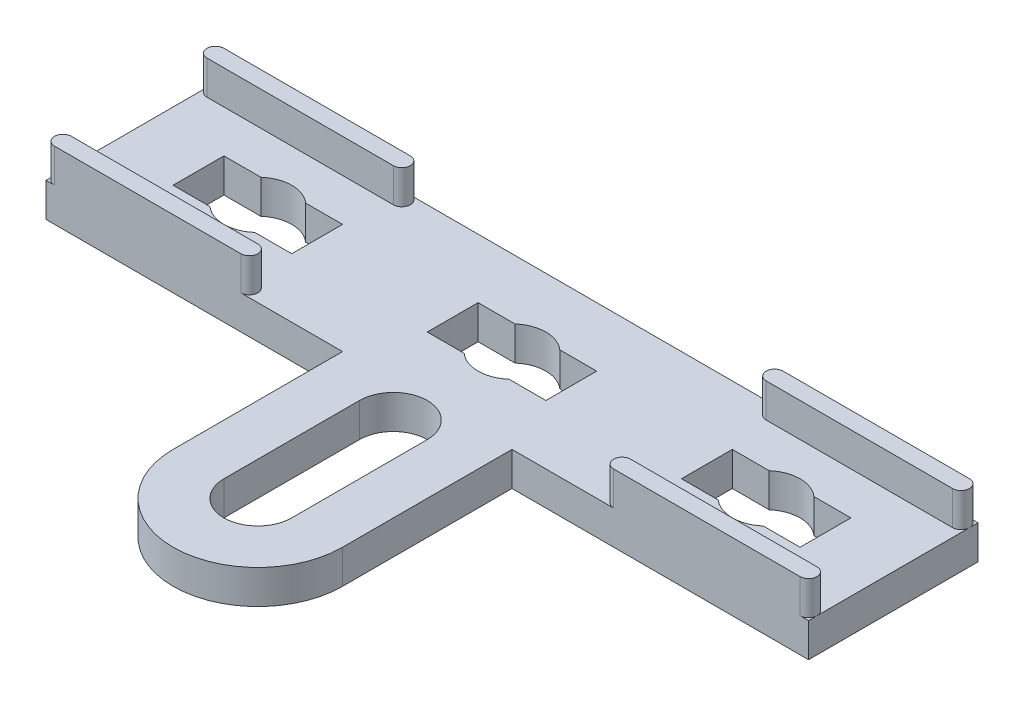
ISO-10303-21;
HEADER;
FILE_DESCRIPTION(('STEP AP214'),'2;1');
FILE_NAME('part.step','',(''),(''),'','','');
FILE_SCHEMA(('AUTOMOTIVE_DESIGN { 1 0 10303 214 1 1 1 1 }'));
ENDSEC;
DATA;
#1=APPLICATION_CONTEXT('core data for automotive mechanical design processes');
#2=APPLICATION_PROTOCOL_DEFINITION('international standard','automotive_design',2000,#1);
#3=PRODUCT_CONTEXT('',#1,'mechanical');
#4=PRODUCT('Part','Part','',(#3));
#5=PRODUCT_RELATED_PRODUCT_CATEGORY('part','',(#4));
#6=PRODUCT_DEFINITION_FORMATION('','',#4);
#7=PRODUCT_DEFINITION_CONTEXT('part definition',#1,'design');
#8=PRODUCT_DEFINITION('design','',#6,#7);
#9=PRODUCT_DEFINITION_SHAPE('','',#8);
#10=(LENGTH_UNIT() NAMED_UNIT(*) SI_UNIT(.MILLI.,.METRE.));
#11=(NAMED_UNIT(*) PLANE_ANGLE_UNIT() SI_UNIT($,.RADIAN.));
#12=(NAMED_UNIT(*) SI_UNIT($,.STERADIAN.) SOLID_ANGLE_UNIT());
#13=UNCERTAINTY_MEASURE_WITH_UNIT(LENGTH_MEASURE(1.E-05),#10,'distance_accuracy_value','');
#14=(GEOMETRIC_REPRESENTATION_CONTEXT(3) GLOBAL_UNCERTAINTY_ASSIGNED_CONTEXT((#13)) GLOBAL_UNIT_ASSIGNED_CONTEXT((#10,
#11,#12)) REPRESENTATION_CONTEXT('',''));
#15=CARTESIAN_POINT('',(0.,0.,0.));
#16=DIRECTION('',(0.,0.,1.));
#17=DIRECTION('',(1.,0.,0.));
#18=AXIS2_PLACEMENT_3D('',#15,#16,#17);
#19=CARTESIAN_POINT('',(0.,2.,15.));
#20=DIRECTION('',(0.,1.,0.));
#21=DIRECTION('',(0.,0.,1.));
#22=AXIS2_PLACEMENT_3D('',#19,#20,#21);
#23=PLANE('',#22);
#24=CARTESIAN_POINT('',(0.,2.,15.));
#25=DIRECTION('',(0.,1.,0.));
#26=DIRECTION('',(0.,0.,1.));
#27=AXIS2_PLACEMENT_3D('',#24,#25,#26);
#28=CIRCLE('',#27,1.99999999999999);
#29=CARTESIAN_POINT('',(-2.00000000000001,2.,15.));
#30=VERTEX_POINT('',#29);
#31=CARTESIAN_POINT('',(1.99999999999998,2.,15.));
#32=VERTEX_POINT('',#31);
#33=EDGE_CURVE('E50',#30,#32,#28,.T.);
#34=ORIENTED_EDGE('',*,*,#33,.F.);
#35=DIRECTION('',(0.,0.,1.));
#36=VECTOR('',#35,1.);
#37=CARTESIAN_POINT('',(-2.00000000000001,2.,7.));
#38=LINE('',#37,#36);
#39=CARTESIAN_POINT('',(-2.00000000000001,2.,7.));
#40=VERTEX_POINT('',#39);
#41=EDGE_CURVE('E394',#40,#30,#38,.T.);
#42=ORIENTED_EDGE('',*,*,#41,.F.);
#43=CARTESIAN_POINT('',(0.,2.,7.));
#44=DIRECTION('',(0.,1.,0.));
#45=DIRECTION('',(0.,0.,1.));
#46=AXIS2_PLACEMENT_3D('',#43,#44,#45);
#47=CIRCLE('',#46,1.99999999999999);
#48=CARTESIAN_POINT('',(1.99999999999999,2.,7.));
#49=VERTEX_POINT('',#48);
#50=EDGE_CURVE('E379',#49,#40,#47,.T.);
#51=ORIENTED_EDGE('',*,*,#50,.F.);
#52=DIRECTION('',(0.,0.,-1.));
#53=VECTOR('',#52,1.);
#54=CARTESIAN_POINT('',(1.99999999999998,2.,15.));
#55=LINE('',#54,#53);
#56=EDGE_CURVE('E388',#32,#49,#55,.T.);
#57=ORIENTED_EDGE('',*,*,#56,.F.);
#58=EDGE_LOOP('',(#34,#42,#51,#57));
#59=FACE_BOUND('',#58,.T.);
#60=CARTESIAN_POINT('',(15.,2.,0.));
#61=DIRECTION('',(0.,1.,0.));
#62=DIRECTION('',(0.,0.,1.));
#63=AXIS2_PLACEMENT_3D('',#60,#61,#62);
#64=CIRCLE('',#63,2.);
#65=CARTESIAN_POINT('',(16.3228756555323,2.,-1.5));
#66=VERTEX_POINT('',#65);
#67=CARTESIAN_POINT('',(13.6771243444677,2.,-1.5));
#68=VERTEX_POINT('',#67);
#69=EDGE_CURVE('E423',#66,#68,#64,.T.);
#70=ORIENTED_EDGE('',*,*,#69,.F.);
#71=DIRECTION('',(-1.,0.,0.));
#72=VECTOR('',#71,1.);
#73=CARTESIAN_POINT('',(18.5,2.,-1.5));
#74=LINE('',#73,#72);
#75=CARTESIAN_POINT('',(18.5,2.,-1.5));
#76=VERTEX_POINT('',#75);
#77=EDGE_CURVE('E443',#76,#66,#74,.T.);
#78=ORIENTED_EDGE('',*,*,#77,.F.);
#79=DIRECTION('',(0.,0.,-1.));
#80=VECTOR('',#79,1.);
#81=CARTESIAN_POINT('',(18.5,2.,-1.5));
#82=LINE('',#81,#80);
#83=CARTESIAN_POINT('',(18.5,2.,1.5));
#84=VERTEX_POINT('',#83);
#85=EDGE_CURVE('E440',#84,#76,#82,.T.);
#86=ORIENTED_EDGE('',*,*,#85,.F.);
#87=DIRECTION('',(1.,0.,0.));
#88=VECTOR('',#87,1.);
#89=CARTESIAN_POINT('',(18.5,2.,1.5));
#90=LINE('',#89,#88);
#91=CARTESIAN_POINT('',(16.3228756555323,2.,1.5));
#92=VERTEX_POINT('',#91);
#93=EDGE_CURVE('E437',#92,#84,#90,.T.);
#94=ORIENTED_EDGE('',*,*,#93,.F.);
#95=CARTESIAN_POINT('',(15.,2.,0.));
#96=DIRECTION('',(0.,1.,0.));
#97=DIRECTION('',(0.,0.,1.));
#98=AXIS2_PLACEMENT_3D('',#95,#96,#97);
#99=CIRCLE('',#98,2.);
#100=CARTESIAN_POINT('',(13.6771243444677,2.,1.5));
#101=VERTEX_POINT('',#100);
#102=EDGE_CURVE('E434',#101,#92,#99,.T.);
#103=ORIENTED_EDGE('',*,*,#102,.F.);
#104=DIRECTION('',(1.,0.,0.));
#105=VECTOR('',#104,1.);
#106=CARTESIAN_POINT('',(13.6771243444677,2.,1.5));
#107=LINE('',#106,#105);
#108=CARTESIAN_POINT('',(11.5,2.,1.5));
#109=VERTEX_POINT('',#108);
#110=EDGE_CURVE('E431',#109,#101,#107,.T.);
#111=ORIENTED_EDGE('',*,*,#110,.F.);
#112=DIRECTION('',(0.,0.,1.));
#113=VECTOR('',#112,1.);
#114=CARTESIAN_POINT('',(11.5,2.,-1.5));
#115=LINE('',#114,#113);
#116=CARTESIAN_POINT('',(11.5,2.,-1.5));
#117=VERTEX_POINT('',#116);
#118=EDGE_CURVE('E428',#117,#109,#115,.T.);
#119=ORIENTED_EDGE('',*,*,#118,.F.);
#120=DIRECTION('',(-1.,0.,0.));
#121=VECTOR('',#120,1.);
#122=CARTESIAN_POINT('',(13.6771243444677,2.,-1.5));
#123=LINE('',#122,#121);
#124=EDGE_CURVE('E425',#68,#117,#123,.T.);
#125=ORIENTED_EDGE('',*,*,#124,.F.);
#126=EDGE_LOOP('',(#70,#78,#86,#94,#103,#111,#119,#125));
#127=FACE_BOUND('',#126,.T.);
#128=CARTESIAN_POINT('',(-15.,2.,0.));
#129=DIRECTION('',(0.,1.,0.));
#130=DIRECTION('',(0.,0.,1.));
#131=AXIS2_PLACEMENT_3D('',#128,#129,#130);
#132=CIRCLE('',#131,2.);
#133=CARTESIAN_POINT('',(-13.6771243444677,2.,-1.5));
#134=VERTEX_POINT('',#133);
#135=CARTESIAN_POINT('',(-16.3228756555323,2.,-1.5));
#136=VERTEX_POINT('',#135);
#137=EDGE_CURVE('E486',#134,#136,#132,.T.);
#138=ORIENTED_EDGE('',*,*,#137,.F.);
#139=DIRECTION('',(-1.,0.,0.));
#140=VECTOR('',#139,1.);
#141=CARTESIAN_POINT('',(-11.5,2.,-1.5));
#142=LINE('',#141,#140);
#143=CARTESIAN_POINT('',(-11.5,2.,-1.5));
#144=VERTEX_POINT('',#143);
#145=EDGE_CURVE('E506',#144,#134,#142,.T.);
#146=ORIENTED_EDGE('',*,*,#145,.F.);
#147=DIRECTION('',(0.,0.,-1.));
#148=VECTOR('',#147,1.);
#149=CARTESIAN_POINT('',(-11.5,2.,-1.5));
#150=LINE('',#149,#148);
#151=CARTESIAN_POINT('',(-11.5,2.,1.5));
#152=VERTEX_POINT('',#151);
#153=EDGE_CURVE('E503',#152,#144,#150,.T.);
#154=ORIENTED_EDGE('',*,*,#153,.F.);
#155=DIRECTION('',(1.,0.,0.));
#156=VECTOR('',#155,1.);
#157=CARTESIAN_POINT('',(-11.5,2.,1.5));
#158=LINE('',#157,#156);
#159=CARTESIAN_POINT('',(-13.6771243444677,2.,1.5));
#160=VERTEX_POINT('',#159);
#161=EDGE_CURVE('E500',#160,#152,#158,.T.);
#162=ORIENTED_EDGE('',*,*,#161,.F.);
#163=CARTESIAN_POINT('',(-15.,2.,0.));
#164=DIRECTION('',(0.,1.,0.));
#165=DIRECTION('',(0.,0.,1.));
#166=AXIS2_PLACEMENT_3D('',#163,#164,#165);
#167=CIRCLE('',#166,2.);
#168=CARTESIAN_POINT('',(-16.3228756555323,2.,1.5));
#169=VERTEX_POINT('',#168);
#170=EDGE_CURVE('E497',#169,#160,#167,.T.);
#171=ORIENTED_EDGE('',*,*,#170,.F.);
#172=DIRECTION('',(1.,0.,0.));
#173=VECTOR('',#172,1.);
#174=CARTESIAN_POINT('',(-16.3228756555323,2.,1.5));
#175=LINE('',#174,#173);
#176=CARTESIAN_POINT('',(-18.5,2.,1.5));
#177=VERTEX_POINT('',#176);
#178=EDGE_CURVE('E494',#177,#169,#175,.T.);
#179=ORIENTED_EDGE('',*,*,#178,.F.);
#180=DIRECTION('',(0.,0.,1.));
#181=VECTOR('',#180,1.);
#182=CARTESIAN_POINT('',(-18.5,2.,-1.5));
#183=LINE('',#182,#181);
#184=CARTESIAN_POINT('',(-18.5,2.,-1.5));
#185=VERTEX_POINT('',#184);
#186=EDGE_CURVE('E491',#185,#177,#183,.T.);
#187=ORIENTED_EDGE('',*,*,#186,.F.);
#188=DIRECTION('',(-1.,0.,0.));
#189=VECTOR('',#188,1.);
#190=CARTESIAN_POINT('',(-16.3228756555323,2.,-1.5));
#191=LINE('',#190,#189);
#192=EDGE_CURVE('E488',#136,#185,#191,.T.);
#193=ORIENTED_EDGE('',*,*,#192,.F.);
#194=EDGE_LOOP('',(#138,#146,#154,#162,#171,#179,#187,#193));
#195=FACE_BOUND('',#194,.T.);
#196=CARTESIAN_POINT('',(0.,2.,0.));
#197=DIRECTION('',(0.,1.,0.));
#198=DIRECTION('',(0.,0.,1.));
#199=AXIS2_PLACEMENT_3D('',#196,#197,#198);
#200=CIRCLE('',#199,2.);
#201=CARTESIAN_POINT('',(1.32287565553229,2.,-1.5));
#202=VERTEX_POINT('',#201);
#203=CARTESIAN_POINT('',(-1.32287565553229,2.,-1.5));
#204=VERTEX_POINT('',#203);
#205=EDGE_CURVE('E549',#202,#204,#200,.T.);
#206=ORIENTED_EDGE('',*,*,#205,.F.);
#207=DIRECTION('',(-1.,0.,0.));
#208=VECTOR('',#207,1.);
#209=CARTESIAN_POINT('',(3.5,2.,-1.5));
#210=LINE('',#209,#208);
#211=CARTESIAN_POINT('',(3.5,2.,-1.5));
#212=VERTEX_POINT('',#211);
#213=EDGE_CURVE('E569',#212,#202,#210,.T.);
#214=ORIENTED_EDGE('',*,*,#213,.F.);
#215=DIRECTION('',(0.,0.,-1.));
#216=VECTOR('',#215,1.);
#217=CARTESIAN_POINT('',(3.5,2.,-1.5));
#218=LINE('',#217,#216);
#219=CARTESIAN_POINT('',(3.5,2.,1.5));
#220=VERTEX_POINT('',#219);
#221=EDGE_CURVE('E566',#220,#212,#218,.T.);
#222=ORIENTED_EDGE('',*,*,#221,.F.);
#223=DIRECTION('',(1.,0.,0.));
#224=VECTOR('',#223,1.);
#225=CARTESIAN_POINT('',(3.5,2.,1.5));
#226=LINE('',#225,#224);
#227=CARTESIAN_POINT('',(1.3228756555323,2.,1.5));
#228=VERTEX_POINT('',#227);
#229=EDGE_CURVE('E563',#228,#220,#226,.T.);
#230=ORIENTED_EDGE('',*,*,#229,.F.);
#231=CARTESIAN_POINT('',(0.,2.,0.));
#232=DIRECTION('',(0.,1.,0.));
#233=DIRECTION('',(0.,0.,1.));
#234=AXIS2_PLACEMENT_3D('',#231,#232,#233);
#235=CIRCLE('',#234,2.);
#236=CARTESIAN_POINT('',(-1.3228756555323,2.,1.5));
#237=VERTEX_POINT('',#236);
#238=EDGE_CURVE('E560',#237,#228,#235,.T.);
#239=ORIENTED_EDGE('',*,*,#238,.F.);
#240=DIRECTION('',(1.,0.,0.));
#241=VECTOR('',#240,1.);
#242=CARTESIAN_POINT('',(-1.3228756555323,2.,1.5));
#243=LINE('',#242,#241);
#244=CARTESIAN_POINT('',(-3.5,2.,1.5));
#245=VERTEX_POINT('',#244);
#246=EDGE_CURVE('E557',#245,#237,#243,.T.);
#247=ORIENTED_EDGE('',*,*,#246,.F.);
#248=DIRECTION('',(0.,0.,1.));
#249=VECTOR('',#248,1.);
#250=CARTESIAN_POINT('',(-3.5,2.,-1.5));
#251=LINE('',#250,#249);
#252=CARTESIAN_POINT('',(-3.5,2.,-1.5));
#253=VERTEX_POINT('',#252);
#254=EDGE_CURVE('E554',#253,#245,#251,.T.);
#255=ORIENTED_EDGE('',*,*,#254,.F.);
#256=DIRECTION('',(-1.,0.,0.));
#257=VECTOR('',#256,1.);
#258=CARTESIAN_POINT('',(-1.32287565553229,2.,-1.5));
#259=LINE('',#258,#257);
#260=EDGE_CURVE('E551',#204,#253,#259,.T.);
#261=ORIENTED_EDGE('',*,*,#260,.F.);
#262=EDGE_LOOP('',(#206,#214,#222,#230,#239,#247,#255,#261));
#263=FACE_BOUND('',#262,.T.);
#264=DIRECTION('',(1.,0.,0.));
#265=VECTOR('',#264,1.);
#266=CARTESIAN_POINT('',(11.,2.,-4.));
#267=LINE('',#266,#265);
#268=CARTESIAN_POINT('',(11.,2.,-4.));
#269=VERTEX_POINT('',#268);
#270=CARTESIAN_POINT('',(22.,2.,-4.));
#271=VERTEX_POINT('',#270);
#272=EDGE_CURVE('E606',#269,#271,#267,.T.);
#273=ORIENTED_EDGE('',*,*,#272,.F.);
#274=CARTESIAN_POINT('',(11.,2.,-4.5));
#275=DIRECTION('',(0.,1.,0.));
#276=DIRECTION('',(0.,0.,1.));
#277=AXIS2_PLACEMENT_3D('',#274,#275,#276);
#278=CIRCLE('',#277,0.5);
#279=CARTESIAN_POINT('',(11.,2.,-5.));
#280=VERTEX_POINT('',#279);
#281=EDGE_CURVE('E592',#280,#269,#278,.T.);
#282=ORIENTED_EDGE('',*,*,#281,.F.);
#283=DIRECTION('',(-1.,0.,0.));
#284=VECTOR('',#283,1.);
#285=CARTESIAN_POINT('',(22.5,2.,-5.));
#286=LINE('',#285,#284);
#287=CARTESIAN_POINT('',(-11.,2.,-4.99999999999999));
#288=VERTEX_POINT('',#287);
#289=EDGE_CURVE('E736',#280,#288,#286,.T.);
#290=ORIENTED_EDGE('',*,*,#289,.T.);
#291=CARTESIAN_POINT('',(-11.,2.,-4.49999999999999));
#292=DIRECTION('',(0.,1.,0.));
#293=DIRECTION('',(0.,0.,1.));
#294=AXIS2_PLACEMENT_3D('',#291,#292,#293);
#295=CIRCLE('',#294,0.5);
#296=CARTESIAN_POINT('',(-11.,2.,-3.99999999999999));
#297=VERTEX_POINT('',#296);
#298=EDGE_CURVE('E688',#297,#288,#295,.T.);
#299=ORIENTED_EDGE('',*,*,#298,.F.);
#300=DIRECTION('',(1.,0.,0.));
#301=VECTOR('',#300,1.);
#302=CARTESIAN_POINT('',(-22.,2.,-3.99999999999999));
#303=LINE('',#302,#301);
#304=CARTESIAN_POINT('',(-22.,2.,-3.99999999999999));
#305=VERTEX_POINT('',#304);
#306=EDGE_CURVE('E701',#305,#297,#303,.T.);
#307=ORIENTED_EDGE('',*,*,#306,.F.);
#308=CARTESIAN_POINT('',(-22.,2.,-4.49999999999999));
#309=DIRECTION('',(0.,1.,0.));
#310=DIRECTION('',(0.,0.,1.));
#311=AXIS2_PLACEMENT_3D('',#308,#309,#310);
#312=CIRCLE('',#311,0.5);
#313=CARTESIAN_POINT('',(-22.5,2.,-4.49999999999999));
#314=VERTEX_POINT('',#313);
#315=EDGE_CURVE('E695',#314,#305,#312,.T.);
#316=ORIENTED_EDGE('',*,*,#315,.F.);
#317=DIRECTION('',(0.,0.,1.));
#318=VECTOR('',#317,1.);
#319=CARTESIAN_POINT('',(-22.5,2.,-4.99999999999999));
#320=LINE('',#319,#318);
#321=CARTESIAN_POINT('',(-22.5,2.,4.49999999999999));
#322=VERTEX_POINT('',#321);
#323=EDGE_CURVE('E797',#314,#322,#320,.T.);
#324=ORIENTED_EDGE('',*,*,#323,.T.);
#325=CARTESIAN_POINT('',(-22.,2.,4.49999999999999));
#326=DIRECTION('',(0.,1.,0.));
#327=DIRECTION('',(0.,0.,1.));
#328=AXIS2_PLACEMENT_3D('',#325,#326,#327);
#329=CIRCLE('',#328,0.5);
#330=CARTESIAN_POINT('',(-22.,2.,3.99999999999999));
#331=VERTEX_POINT('',#330);
#332=EDGE_CURVE('E699',#331,#322,#329,.T.);
#333=ORIENTED_EDGE('',*,*,#332,.F.);
#334=DIRECTION('',(1.,0.,0.));
#335=VECTOR('',#334,1.);
#336=CARTESIAN_POINT('',(-22.,2.,3.99999999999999));
#337=LINE('',#336,#335);
#338=CARTESIAN_POINT('',(-11.,2.,3.99999999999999));
#339=VERTEX_POINT('',#338);
#340=EDGE_CURVE('E658',#331,#339,#337,.T.);
#341=ORIENTED_EDGE('',*,*,#340,.T.);
#342=CARTESIAN_POINT('',(-11.,2.,4.49999999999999));
#343=DIRECTION('',(0.,-1.,0.));
#344=DIRECTION('',(0.,0.,-1.));
#345=AXIS2_PLACEMENT_3D('',#342,#343,#344);
#346=CIRCLE('',#345,0.5);
#347=CARTESIAN_POINT('',(-11.,2.,5.00000000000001));
#348=VERTEX_POINT('',#347);
#349=EDGE_CURVE('E669',#339,#348,#346,.T.);
#350=ORIENTED_EDGE('',*,*,#349,.T.);
#351=DIRECTION('',(1.,0.,0.));
#352=VECTOR('',#351,1.);
#353=CARTESIAN_POINT('',(-5.00000000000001,2.,5.));
#354=LINE('',#353,#352);
#355=CARTESIAN_POINT('',(-5.00000000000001,2.,5.));
#356=VERTEX_POINT('',#355);
#357=EDGE_CURVE('E790',#348,#356,#354,.T.);
#358=ORIENTED_EDGE('',*,*,#357,.T.);
#359=DIRECTION('',(0.,0.,1.));
#360=VECTOR('',#359,1.);
#361=CARTESIAN_POINT('',(-5.00000000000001,2.,5.));
#362=LINE('',#361,#360);
#363=CARTESIAN_POINT('',(-5.00000000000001,2.,15.));
#364=VERTEX_POINT('',#363);
#365=EDGE_CURVE('E788',#356,#364,#362,.T.);
#366=ORIENTED_EDGE('',*,*,#365,.T.);
#367=CARTESIAN_POINT('',(0.,2.,15.));
#368=DIRECTION('',(0.,1.,0.));
#369=DIRECTION('',(0.,0.,1.));
#370=AXIS2_PLACEMENT_3D('',#367,#368,#369);
#371=CIRCLE('',#370,4.99999999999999);
#372=CARTESIAN_POINT('',(4.99999999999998,2.,15.));
#373=VERTEX_POINT('',#372);
#374=EDGE_CURVE('E786',#364,#373,#371,.T.);
#375=ORIENTED_EDGE('',*,*,#374,.T.);
#376=DIRECTION('',(0.,0.,-1.));
#377=VECTOR('',#376,1.);
#378=CARTESIAN_POINT('',(4.99999999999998,2.,15.));
#379=LINE('',#378,#377);
#380=CARTESIAN_POINT('',(4.99999999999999,2.,5.00000000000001));
#381=VERTEX_POINT('',#380);
#382=EDGE_CURVE('E784',#373,#381,#379,.T.);
#383=ORIENTED_EDGE('',*,*,#382,.T.);
#384=DIRECTION('',(1.,0.,0.));
#385=VECTOR('',#384,1.);
#386=CARTESIAN_POINT('',(22.5,2.,5.));
#387=LINE('',#386,#385);
#388=CARTESIAN_POINT('',(11.,2.,5.));
#389=VERTEX_POINT('',#388);
#390=EDGE_CURVE('E781',#381,#389,#387,.T.);
#391=ORIENTED_EDGE('',*,*,#390,.T.);
#392=CARTESIAN_POINT('',(11.,2.,4.49999999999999));
#393=DIRECTION('',(0.,-1.,0.));
#394=DIRECTION('',(0.,0.,-1.));
#395=AXIS2_PLACEMENT_3D('',#392,#393,#394);
#396=CIRCLE('',#395,0.5);
#397=CARTESIAN_POINT('',(11.,2.,3.99999999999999));
#398=VERTEX_POINT('',#397);
#399=EDGE_CURVE('E623',#389,#398,#396,.T.);
#400=ORIENTED_EDGE('',*,*,#399,.T.);
#401=DIRECTION('',(1.,0.,0.));
#402=VECTOR('',#401,1.);
#403=CARTESIAN_POINT('',(11.,2.,3.99999999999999));
#404=LINE('',#403,#402);
#405=CARTESIAN_POINT('',(22.,2.,3.99999999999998));
#406=VERTEX_POINT('',#405);
#407=EDGE_CURVE('E628',#398,#406,#404,.T.);
#408=ORIENTED_EDGE('',*,*,#407,.T.);
#409=CARTESIAN_POINT('',(22.,2.,4.49999999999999));
#410=DIRECTION('',(0.,-1.,0.));
#411=DIRECTION('',(0.,0.,-1.));
#412=AXIS2_PLACEMENT_3D('',#409,#410,#411);
#413=CIRCLE('',#412,0.5);
#414=CARTESIAN_POINT('',(22.5,2.,4.49999999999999));
#415=VERTEX_POINT('',#414);
#416=EDGE_CURVE('E639',#406,#415,#413,.T.);
#417=ORIENTED_EDGE('',*,*,#416,.T.);
#418=DIRECTION('',(0.,0.,-1.));
#419=VECTOR('',#418,1.);
#420=CARTESIAN_POINT('',(22.5,2.,-5.));
#421=LINE('',#420,#419);
#422=CARTESIAN_POINT('',(22.5,2.,-4.5));
#423=VERTEX_POINT('',#422);
#424=EDGE_CURVE('E779',#415,#423,#421,.T.);
#425=ORIENTED_EDGE('',*,*,#424,.T.);
#426=CARTESIAN_POINT('',(22.,2.,-4.5));
#427=DIRECTION('',(0.,1.,0.));
#428=DIRECTION('',(0.,0.,1.));
#429=AXIS2_PLACEMENT_3D('',#426,#427,#428);
#430=CIRCLE('',#429,0.5);
#431=EDGE_CURVE('E597',#271,#423,#430,.T.);
#432=ORIENTED_EDGE('',*,*,#431,.F.);
#433=EDGE_LOOP('',(#273,#282,#290,#299,#307,#316,#324,#333,#341,#350,#358,#366,#375,#383,#391,
#400,#408,#417,#425,#432));
#434=FACE_BOUND('',#433,.T.);
#435=ADVANCED_FACE('F35',(#59,#127,#195,#263,#434),#23,.T.);
#436=CARTESIAN_POINT('',(22.5,2.,-5.));
#437=VERTEX_POINT('',#436);
#438=CARTESIAN_POINT('',(22.,2.,-5.));
#439=VERTEX_POINT('',#438);
#440=EDGE_CURVE('E733',#437,#439,#286,.T.);
#441=ORIENTED_EDGE('',*,*,#440,.T.);
#442=EDGE_CURVE('E609',#423,#439,#430,.T.);
#443=ORIENTED_EDGE('',*,*,#442,.F.);
#444=EDGE_CURVE('E780',#423,#437,#421,.T.);
#445=ORIENTED_EDGE('',*,*,#444,.T.);
#446=EDGE_LOOP('',(#441,#443,#445));
#447=FACE_BOUND('',#446,.T.);
#448=ADVANCED_FACE('F847',(#447),#23,.T.);
#449=CARTESIAN_POINT('',(-22.,2.,4.49999999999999));
#450=DIRECTION('',(0.,-1.,0.));
#451=DIRECTION('',(0.,0.,-1.));
#452=AXIS2_PLACEMENT_3D('',#449,#450,#451);
#453=CIRCLE('',#452,0.5);
#454=CARTESIAN_POINT('',(-22.,2.,5.00000000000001));
#455=VERTEX_POINT('',#454);
#456=EDGE_CURVE('E653',#455,#322,#453,.T.);
#457=ORIENTED_EDGE('',*,*,#456,.T.);
#458=CARTESIAN_POINT('',(-22.5,2.,5.00000000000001));
#459=VERTEX_POINT('',#458);
#460=EDGE_CURVE('E735',#322,#459,#320,.T.);
#461=ORIENTED_EDGE('',*,*,#460,.T.);
#462=EDGE_CURVE('E789',#459,#455,#354,.T.);
#463=ORIENTED_EDGE('',*,*,#462,.T.);
#464=EDGE_LOOP('',(#457,#461,#463));
#465=FACE_BOUND('',#464,.T.);
#466=ADVANCED_FACE('F803',(#465),#23,.T.);
#467=CARTESIAN_POINT('',(-22.,2.,-4.99999999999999));
#468=VERTEX_POINT('',#467);
#469=EDGE_CURVE('E683',#468,#314,#312,.T.);
#470=ORIENTED_EDGE('',*,*,#469,.F.);
#471=CARTESIAN_POINT('',(-22.5,2.,-4.99999999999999));
#472=VERTEX_POINT('',#471);
#473=EDGE_CURVE('E707',#468,#472,#286,.T.);
#474=ORIENTED_EDGE('',*,*,#473,.T.);
#475=EDGE_CURVE('E728',#472,#314,#320,.T.);
#476=ORIENTED_EDGE('',*,*,#475,.T.);
#477=EDGE_LOOP('',(#470,#474,#476));
#478=FACE_BOUND('',#477,.T.);
#479=ADVANCED_FACE('F859',(#478),#23,.T.);
#480=CARTESIAN_POINT('',(22.5,2.,-5.));
#481=DIRECTION('',(0.,0.,1.));
#482=DIRECTION('',(1.,0.,0.));
#483=AXIS2_PLACEMENT_3D('',#480,#481,#482);
#484=PLANE('',#483);
#485=DIRECTION('',(-1.,0.,0.));
#486=VECTOR('',#485,1.);
#487=CARTESIAN_POINT('',(22.5,0.,-5.));
#488=LINE('',#487,#486);
#489=CARTESIAN_POINT('',(22.5,0.,-5.));
#490=VERTEX_POINT('',#489);
#491=CARTESIAN_POINT('',(-22.5,0.,-4.99999999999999));
#492=VERTEX_POINT('',#491);
#493=EDGE_CURVE('E725',#490,#492,#488,.T.);
#494=ORIENTED_EDGE('',*,*,#493,.T.);
#495=DIRECTION('',(0.,-1.,0.));
#496=VECTOR('',#495,1.);
#497=CARTESIAN_POINT('',(-22.5,2.,-4.99999999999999));
#498=LINE('',#497,#496);
#499=EDGE_CURVE('E700',#472,#492,#498,.T.);
#500=ORIENTED_EDGE('',*,*,#499,.F.);
#501=ORIENTED_EDGE('',*,*,#473,.F.);
#502=DIRECTION('',(0.,-1.,0.));
#503=VECTOR('',#502,1.);
#504=CARTESIAN_POINT('',(-22.,4.,-4.99999999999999));
#505=LINE('',#504,#503);
#506=CARTESIAN_POINT('',(-22.,4.,-4.99999999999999));
#507=VERTEX_POINT('',#506);
#508=EDGE_CURVE('E694',#507,#468,#505,.T.);
#509=ORIENTED_EDGE('',*,*,#508,.F.);
#510=DIRECTION('',(-1.,0.,0.));
#511=VECTOR('',#510,1.);
#512=CARTESIAN_POINT('',(-22.,4.,-4.99999999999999));
#513=LINE('',#512,#511);
#514=CARTESIAN_POINT('',(-11.,4.,-4.99999999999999));
#515=VERTEX_POINT('',#514);
#516=EDGE_CURVE('E692',#515,#507,#513,.T.);
#517=ORIENTED_EDGE('',*,*,#516,.F.);
#518=DIRECTION('',(0.,-1.,0.));
#519=VECTOR('',#518,1.);
#520=CARTESIAN_POINT('',(-11.,4.,-4.99999999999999));
#521=LINE('',#520,#519);
#522=EDGE_CURVE('E712',#515,#288,#521,.T.);
#523=ORIENTED_EDGE('',*,*,#522,.T.);
#524=ORIENTED_EDGE('',*,*,#289,.F.);
#525=DIRECTION('',(0.,-1.,0.));
#526=VECTOR('',#525,1.);
#527=CARTESIAN_POINT('',(11.,4.,-5.));
#528=LINE('',#527,#526);
#529=CARTESIAN_POINT('',(11.,4.,-5.));
#530=VERTEX_POINT('',#529);
#531=EDGE_CURVE('E603',#530,#280,#528,.T.);
#532=ORIENTED_EDGE('',*,*,#531,.F.);
#533=DIRECTION('',(-1.,0.,0.));
#534=VECTOR('',#533,1.);
#535=CARTESIAN_POINT('',(11.,4.,-5.));
#536=LINE('',#535,#534);
#537=CARTESIAN_POINT('',(22.,4.,-5.));
#538=VERTEX_POINT('',#537);
#539=EDGE_CURVE('E601',#538,#530,#536,.T.);
#540=ORIENTED_EDGE('',*,*,#539,.F.);
#541=DIRECTION('',(0.,-1.,0.));
#542=VECTOR('',#541,1.);
#543=CARTESIAN_POINT('',(22.,4.,-5.));
#544=LINE('',#543,#542);
#545=EDGE_CURVE('E614',#538,#439,#544,.T.);
#546=ORIENTED_EDGE('',*,*,#545,.T.);
#547=ORIENTED_EDGE('',*,*,#440,.F.);
#548=DIRECTION('',(0.,-1.,0.));
#549=VECTOR('',#548,1.);
#550=CARTESIAN_POINT('',(22.5,2.,-5.));
#551=LINE('',#550,#549);
#552=EDGE_CURVE('E757',#437,#490,#551,.T.);
#553=ORIENTED_EDGE('',*,*,#552,.T.);
#554=EDGE_LOOP('',(#494,#500,#501,#509,#517,#523,#524,#532,#540,#546,#547,#553));
#555=FACE_BOUND('',#554,.T.);
#556=ADVANCED_FACE('F37',(#555),#484,.F.);
#557=CARTESIAN_POINT('',(-22.5,2.,-4.99999999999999));
#558=DIRECTION('',(1.,0.,0.));
#559=DIRECTION('',(0.,0.,-1.));
#560=AXIS2_PLACEMENT_3D('',#557,#558,#559);
#561=PLANE('',#560);
#562=DIRECTION('',(0.,0.,1.));
#563=VECTOR('',#562,1.);
#564=CARTESIAN_POINT('',(-22.5,0.,-4.99999999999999));
#565=LINE('',#564,#563);
#566=CARTESIAN_POINT('',(-22.5,0.,5.00000000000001));
#567=VERTEX_POINT('',#566);
#568=EDGE_CURVE('E773',#492,#567,#565,.T.);
#569=ORIENTED_EDGE('',*,*,#568,.T.);
#570=DIRECTION('',(0.,-1.,0.));
#571=VECTOR('',#570,1.);
#572=CARTESIAN_POINT('',(-22.5,2.,5.00000000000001));
#573=LINE('',#572,#571);
#574=EDGE_CURVE('E739',#459,#567,#573,.T.);
#575=ORIENTED_EDGE('',*,*,#574,.F.);
#576=ORIENTED_EDGE('',*,*,#460,.F.);
#577=ORIENTED_EDGE('',*,*,#323,.F.);
#578=ORIENTED_EDGE('',*,*,#475,.F.);
#579=ORIENTED_EDGE('',*,*,#499,.T.);
#580=EDGE_LOOP('',(#569,#575,#576,#577,#578,#579));
#581=FACE_BOUND('',#580,.T.);
#582=ADVANCED_FACE('F807',(#581),#561,.F.);
#583=CARTESIAN_POINT('',(-5.00000000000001,2.,5.));
#584=DIRECTION('',(0.,0.,-1.));
#585=DIRECTION('',(-1.,0.,0.));
#586=AXIS2_PLACEMENT_3D('',#583,#584,#585);
#587=PLANE('',#586);
#588=DIRECTION('',(1.,0.,0.));
#589=VECTOR('',#588,1.);
#590=CARTESIAN_POINT('',(-5.00000000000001,0.,5.));
#591=LINE('',#590,#589);
#592=CARTESIAN_POINT('',(-5.00000000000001,0.,5.));
#593=VERTEX_POINT('',#592);
#594=EDGE_CURVE('E771',#567,#593,#591,.T.);
#595=ORIENTED_EDGE('',*,*,#594,.T.);
#596=DIRECTION('',(0.,-1.,0.));
#597=VECTOR('',#596,1.);
#598=CARTESIAN_POINT('',(-5.00000000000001,2.,5.));
#599=LINE('',#598,#597);
#600=EDGE_CURVE('E742',#356,#593,#599,.T.);
#601=ORIENTED_EDGE('',*,*,#600,.F.);
#602=ORIENTED_EDGE('',*,*,#357,.F.);
#603=DIRECTION('',(0.,-1.,0.));
#604=VECTOR('',#603,1.);
#605=CARTESIAN_POINT('',(-11.,4.,4.99999999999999));
#606=LINE('',#605,#604);
#607=CARTESIAN_POINT('',(-11.,4.,4.99999999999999));
#608=VERTEX_POINT('',#607);
#609=EDGE_CURVE('E677',#608,#348,#606,.T.);
#610=ORIENTED_EDGE('',*,*,#609,.F.);
#611=DIRECTION('',(-1.,0.,0.));
#612=VECTOR('',#611,1.);
#613=CARTESIAN_POINT('',(-22.,4.,4.99999999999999));
#614=LINE('',#613,#612);
#615=CARTESIAN_POINT('',(-22.,4.,4.99999999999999));
#616=VERTEX_POINT('',#615);
#617=EDGE_CURVE('E657',#608,#616,#614,.T.);
#618=ORIENTED_EDGE('',*,*,#617,.T.);
#619=DIRECTION('',(0.,-1.,0.));
#620=VECTOR('',#619,1.);
#621=CARTESIAN_POINT('',(-22.,4.,4.99999999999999));
#622=LINE('',#621,#620);
#623=EDGE_CURVE('E680',#616,#455,#622,.T.);
#624=ORIENTED_EDGE('',*,*,#623,.T.);
#625=ORIENTED_EDGE('',*,*,#462,.F.);
#626=ORIENTED_EDGE('',*,*,#574,.T.);
#627=EDGE_LOOP('',(#595,#601,#602,#610,#618,#624,#625,#626));
#628=FACE_BOUND('',#627,.T.);
#629=ADVANCED_FACE('F810',(#628),#587,.F.);
#630=CARTESIAN_POINT('',(-5.00000000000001,2.,5.));
#631=DIRECTION('',(1.,0.,0.));
#632=DIRECTION('',(0.,0.,-1.));
#633=AXIS2_PLACEMENT_3D('',#630,#631,#632);
#634=PLANE('',#633);
#635=DIRECTION('',(0.,0.,1.));
#636=VECTOR('',#635,1.);
#637=CARTESIAN_POINT('',(-5.00000000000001,0.,5.));
#638=LINE('',#637,#636);
#639=CARTESIAN_POINT('',(-5.00000000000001,0.,15.));
#640=VERTEX_POINT('',#639);
#641=EDGE_CURVE('E769',#593,#640,#638,.T.);
#642=ORIENTED_EDGE('',*,*,#641,.T.);
#643=DIRECTION('',(0.,-1.,0.));
#644=VECTOR('',#643,1.);
#645=CARTESIAN_POINT('',(-5.00000000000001,2.,15.));
#646=LINE('',#645,#644);
#647=EDGE_CURVE('E745',#364,#640,#646,.T.);
#648=ORIENTED_EDGE('',*,*,#647,.F.);
#649=ORIENTED_EDGE('',*,*,#365,.F.);
#650=ORIENTED_EDGE('',*,*,#600,.T.);
#651=EDGE_LOOP('',(#642,#648,#649,#650));
#652=FACE_BOUND('',#651,.T.);
#653=ADVANCED_FACE('F1110',(#652),#634,.F.);
#654=CARTESIAN_POINT('',(0.,2.,15.));
#655=DIRECTION('',(0.,-1.,0.));
#656=DIRECTION('',(0.,0.,-1.));
#657=AXIS2_PLACEMENT_3D('',#654,#655,#656);
#658=CYLINDRICAL_SURFACE('',#657,4.99999999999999);
#659=CARTESIAN_POINT('',(0.,0.,15.));
#660=DIRECTION('',(0.,1.,0.));
#661=DIRECTION('',(0.,0.,1.));
#662=AXIS2_PLACEMENT_3D('',#659,#660,#661);
#663=CIRCLE('',#662,4.99999999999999);
#664=CARTESIAN_POINT('',(4.99999999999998,0.,15.));
#665=VERTEX_POINT('',#664);
#666=EDGE_CURVE('E767',#640,#665,#663,.T.);
#667=ORIENTED_EDGE('',*,*,#666,.T.);
#668=DIRECTION('',(0.,-1.,0.));
#669=VECTOR('',#668,1.);
#670=CARTESIAN_POINT('',(4.99999999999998,2.,15.));
#671=LINE('',#670,#669);
#672=EDGE_CURVE('E748',#373,#665,#671,.T.);
#673=ORIENTED_EDGE('',*,*,#672,.F.);
#674=ORIENTED_EDGE('',*,*,#374,.F.);
#675=ORIENTED_EDGE('',*,*,#647,.T.);
#676=EDGE_LOOP('',(#667,#673,#674,#675));
#677=FACE_BOUND('',#676,.T.);
#678=ADVANCED_FACE('F1106',(#677),#658,.T.);
#679=CARTESIAN_POINT('',(4.99999999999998,2.,15.));
#680=DIRECTION('',(-1.,0.,0.));
#681=DIRECTION('',(0.,0.,1.));
#682=AXIS2_PLACEMENT_3D('',#679,#680,#681);
#683=PLANE('',#682);
#684=DIRECTION('',(0.,0.,-1.));
#685=VECTOR('',#684,1.);
#686=CARTESIAN_POINT('',(4.99999999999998,0.,15.));
#687=LINE('',#686,#685);
#688=CARTESIAN_POINT('',(4.99999999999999,0.,5.00000000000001));
#689=VERTEX_POINT('',#688);
#690=EDGE_CURVE('E765',#665,#689,#687,.T.);
#691=ORIENTED_EDGE('',*,*,#690,.T.);
#692=DIRECTION('',(0.,-1.,0.));
#693=VECTOR('',#692,1.);
#694=CARTESIAN_POINT('',(4.99999999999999,2.,5.00000000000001));
#695=LINE('',#694,#693);
#696=EDGE_CURVE('E751',#381,#689,#695,.T.);
#697=ORIENTED_EDGE('',*,*,#696,.F.);
#698=ORIENTED_EDGE('',*,*,#382,.F.);
#699=ORIENTED_EDGE('',*,*,#672,.T.);
#700=EDGE_LOOP('',(#691,#697,#698,#699));
#701=FACE_BOUND('',#700,.T.);
#702=ADVANCED_FACE('F1101',(#701),#683,.F.);
#703=CARTESIAN_POINT('',(22.5,2.,5.));
#704=DIRECTION('',(0.,0.,-1.));
#705=DIRECTION('',(-1.,0.,0.));
#706=AXIS2_PLACEMENT_3D('',#703,#704,#705);
#707=PLANE('',#706);
#708=DIRECTION('',(1.,0.,0.));
#709=VECTOR('',#708,1.);
#710=CARTESIAN_POINT('',(22.5,0.,5.));
#711=LINE('',#710,#709);
#712=CARTESIAN_POINT('',(22.5,0.,5.));
#713=VERTEX_POINT('',#712);
#714=EDGE_CURVE('E763',#689,#713,#711,.T.);
#715=ORIENTED_EDGE('',*,*,#714,.T.);
#716=DIRECTION('',(0.,-1.,0.));
#717=VECTOR('',#716,1.);
#718=CARTESIAN_POINT('',(22.5,2.,5.));
#719=LINE('',#718,#717);
#720=CARTESIAN_POINT('',(22.5,2.,5.));
#721=VERTEX_POINT('',#720);
#722=EDGE_CURVE('E754',#721,#713,#719,.T.);
#723=ORIENTED_EDGE('',*,*,#722,.F.);
#724=CARTESIAN_POINT('',(22.,2.,5.));
#725=VERTEX_POINT('',#724);
#726=EDGE_CURVE('E783',#725,#721,#387,.T.);
#727=ORIENTED_EDGE('',*,*,#726,.F.);
#728=DIRECTION('',(0.,-1.,0.));
#729=VECTOR('',#728,1.);
#730=CARTESIAN_POINT('',(22.,4.,4.99999999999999));
#731=LINE('',#730,#729);
#732=CARTESIAN_POINT('',(22.,4.,4.99999999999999));
#733=VERTEX_POINT('',#732);
#734=EDGE_CURVE('E647',#733,#725,#731,.T.);
#735=ORIENTED_EDGE('',*,*,#734,.F.);
#736=DIRECTION('',(-1.,0.,0.));
#737=VECTOR('',#736,1.);
#738=CARTESIAN_POINT('',(11.,4.,4.99999999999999));
#739=LINE('',#738,#737);
#740=CARTESIAN_POINT('',(11.,4.,4.99999999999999));
#741=VERTEX_POINT('',#740);
#742=EDGE_CURVE('E627',#733,#741,#739,.T.);
#743=ORIENTED_EDGE('',*,*,#742,.T.);
#744=DIRECTION('',(0.,-1.,0.));
#745=VECTOR('',#744,1.);
#746=CARTESIAN_POINT('',(11.,4.,4.99999999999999));
#747=LINE('',#746,#745);
#748=EDGE_CURVE('E650',#741,#389,#747,.T.);
#749=ORIENTED_EDGE('',*,*,#748,.T.);
#750=ORIENTED_EDGE('',*,*,#390,.F.);
#751=ORIENTED_EDGE('',*,*,#696,.T.);
#752=EDGE_LOOP('',(#715,#723,#727,#735,#743,#749,#750,#751));
#753=FACE_BOUND('',#752,.T.);
#754=ADVANCED_FACE('F865',(#753),#707,.F.);
#755=CARTESIAN_POINT('',(22.5,2.,-5.));
#756=DIRECTION('',(-1.,0.,0.));
#757=DIRECTION('',(0.,0.,1.));
#758=AXIS2_PLACEMENT_3D('',#755,#756,#757);
#759=PLANE('',#758);
#760=DIRECTION('',(0.,0.,-1.));
#761=VECTOR('',#760,1.);
#762=CARTESIAN_POINT('',(22.5,0.,-5.));
#763=LINE('',#762,#761);
#764=EDGE_CURVE('E761',#713,#490,#763,.T.);
#765=ORIENTED_EDGE('',*,*,#764,.T.);
#766=ORIENTED_EDGE('',*,*,#552,.F.);
#767=ORIENTED_EDGE('',*,*,#444,.F.);
#768=ORIENTED_EDGE('',*,*,#424,.F.);
#769=EDGE_CURVE('E760',#721,#415,#421,.T.);
#770=ORIENTED_EDGE('',*,*,#769,.F.);
#771=ORIENTED_EDGE('',*,*,#722,.T.);
#772=EDGE_LOOP('',(#765,#766,#767,#768,#770,#771));
#773=FACE_BOUND('',#772,.T.);
#774=ADVANCED_FACE('F857',(#773),#759,.F.);
#775=CARTESIAN_POINT('',(22.,2.,4.49999999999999));
#776=DIRECTION('',(0.,1.,0.));
#777=DIRECTION('',(0.,0.,1.));
#778=AXIS2_PLACEMENT_3D('',#775,#776,#777);
#779=CIRCLE('',#778,0.5);
#780=EDGE_CURVE('E817',#725,#415,#779,.T.);
#781=ORIENTED_EDGE('',*,*,#780,.F.);
#782=ORIENTED_EDGE('',*,*,#726,.T.);
#783=ORIENTED_EDGE('',*,*,#769,.T.);
#784=EDGE_LOOP('',(#781,#782,#783));
#785=FACE_BOUND('',#784,.T.);
#786=ADVANCED_FACE('F849',(#785),#23,.T.);
#787=CARTESIAN_POINT('',(0.,0.,15.));
#788=DIRECTION('',(0.,1.,0.));
#789=DIRECTION('',(0.,0.,1.));
#790=AXIS2_PLACEMENT_3D('',#787,#788,#789);
#791=PLANE('',#790);
#792=DIRECTION('',(0.,0.,1.));
#793=VECTOR('',#792,1.);
#794=CARTESIAN_POINT('',(-2.00000000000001,0.,15.));
#795=LINE('',#794,#793);
#796=CARTESIAN_POINT('',(-2.00000000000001,0.,7.));
#797=VERTEX_POINT('',#796);
#798=CARTESIAN_POINT('',(-2.00000000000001,0.,15.));
#799=VERTEX_POINT('',#798);
#800=EDGE_CURVE('E43',#797,#799,#795,.T.);
#801=ORIENTED_EDGE('',*,*,#800,.T.);
#802=CARTESIAN_POINT('',(0.,0.,15.));
#803=DIRECTION('',(0.,1.,0.));
#804=DIRECTION('',(0.,0.,1.));
#805=AXIS2_PLACEMENT_3D('',#802,#803,#804);
#806=CIRCLE('',#805,1.99999999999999);
#807=CARTESIAN_POINT('',(1.99999999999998,0.,15.));
#808=VERTEX_POINT('',#807);
#809=EDGE_CURVE('E11',#799,#808,#806,.T.);
#810=ORIENTED_EDGE('',*,*,#809,.T.);
#811=DIRECTION('',(0.,0.,-1.));
#812=VECTOR('',#811,1.);
#813=CARTESIAN_POINT('',(1.99999999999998,0.,15.));
#814=LINE('',#813,#812);
#815=CARTESIAN_POINT('',(1.99999999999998,0.,7.));
#816=VERTEX_POINT('',#815);
#817=EDGE_CURVE('E820',#808,#816,#814,.T.);
#818=ORIENTED_EDGE('',*,*,#817,.T.);
#819=CARTESIAN_POINT('',(0.,0.,7.));
#820=DIRECTION('',(0.,1.,0.));
#821=DIRECTION('',(0.,0.,1.));
#822=AXIS2_PLACEMENT_3D('',#819,#820,#821);
#823=CIRCLE('',#822,1.99999999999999);
#824=EDGE_CURVE('E382',#816,#797,#823,.T.);
#825=ORIENTED_EDGE('',*,*,#824,.T.);
#826=EDGE_LOOP('',(#801,#810,#818,#825));
#827=FACE_BOUND('',#826,.T.);
#828=DIRECTION('',(1.,0.,0.));
#829=VECTOR('',#828,1.);
#830=CARTESIAN_POINT('',(18.5,0.,-1.5));
#831=LINE('',#830,#829);
#832=CARTESIAN_POINT('',(16.3228756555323,0.,-1.5));
#833=VERTEX_POINT('',#832);
#834=CARTESIAN_POINT('',(18.5,0.,-1.5));
#835=VERTEX_POINT('',#834);
#836=EDGE_CURVE('E417',#833,#835,#831,.T.);
#837=ORIENTED_EDGE('',*,*,#836,.F.);
#838=CARTESIAN_POINT('',(15.,0.,0.));
#839=DIRECTION('',(0.,1.,0.));
#840=DIRECTION('',(0.,0.,1.));
#841=AXIS2_PLACEMENT_3D('',#838,#839,#840);
#842=CIRCLE('',#841,2.);
#843=CARTESIAN_POINT('',(13.6771243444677,0.,-1.5));
#844=VERTEX_POINT('',#843);
#845=EDGE_CURVE('E420',#844,#833,#842,.F.);
#846=ORIENTED_EDGE('',*,*,#845,.F.);
#847=DIRECTION('',(1.,0.,0.));
#848=VECTOR('',#847,1.);
#849=CARTESIAN_POINT('',(13.6771243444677,0.,-1.5));
#850=LINE('',#849,#848);
#851=CARTESIAN_POINT('',(11.5,0.,-1.5));
#852=VERTEX_POINT('',#851);
#853=EDGE_CURVE('E449',#852,#844,#850,.T.);
#854=ORIENTED_EDGE('',*,*,#853,.F.);
#855=DIRECTION('',(0.,0.,-1.));
#856=VECTOR('',#855,1.);
#857=CARTESIAN_POINT('',(11.5,0.,-1.5));
#858=LINE('',#857,#856);
#859=CARTESIAN_POINT('',(11.5,0.,1.5));
#860=VERTEX_POINT('',#859);
#861=EDGE_CURVE('E401',#860,#852,#858,.T.);
#862=ORIENTED_EDGE('',*,*,#861,.F.);
#863=DIRECTION('',(-1.,0.,0.));
#864=VECTOR('',#863,1.);
#865=CARTESIAN_POINT('',(13.6771243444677,0.,1.5));
#866=LINE('',#865,#864);
#867=CARTESIAN_POINT('',(13.6771243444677,0.,1.5));
#868=VERTEX_POINT('',#867);
#869=EDGE_CURVE('E405',#868,#860,#866,.T.);
#870=ORIENTED_EDGE('',*,*,#869,.F.);
#871=CARTESIAN_POINT('',(15.,0.,0.));
#872=DIRECTION('',(0.,1.,0.));
#873=DIRECTION('',(0.,0.,1.));
#874=AXIS2_PLACEMENT_3D('',#871,#872,#873);
#875=CIRCLE('',#874,2.);
#876=CARTESIAN_POINT('',(16.3228756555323,0.,1.5));
#877=VERTEX_POINT('',#876);
#878=EDGE_CURVE('E408',#877,#868,#875,.F.);
#879=ORIENTED_EDGE('',*,*,#878,.F.);
#880=DIRECTION('',(-1.,0.,0.));
#881=VECTOR('',#880,1.);
#882=CARTESIAN_POINT('',(18.5,0.,1.5));
#883=LINE('',#882,#881);
#884=CARTESIAN_POINT('',(18.5,0.,1.5));
#885=VERTEX_POINT('',#884);
#886=EDGE_CURVE('E411',#885,#877,#883,.T.);
#887=ORIENTED_EDGE('',*,*,#886,.F.);
#888=DIRECTION('',(0.,0.,1.));
#889=VECTOR('',#888,1.);
#890=CARTESIAN_POINT('',(18.5,0.,-1.5));
#891=LINE('',#890,#889);
#892=EDGE_CURVE('E414',#835,#885,#891,.T.);
#893=ORIENTED_EDGE('',*,*,#892,.F.);
#894=EDGE_LOOP('',(#837,#846,#854,#862,#870,#879,#887,#893));
#895=FACE_BOUND('',#894,.T.);
#896=DIRECTION('',(1.,0.,0.));
#897=VECTOR('',#896,1.);
#898=CARTESIAN_POINT('',(-11.5,0.,-1.5));
#899=LINE('',#898,#897);
#900=CARTESIAN_POINT('',(-13.6771243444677,0.,-1.5));
#901=VERTEX_POINT('',#900);
#902=CARTESIAN_POINT('',(-11.5,0.,-1.5));
#903=VERTEX_POINT('',#902);
#904=EDGE_CURVE('E480',#901,#903,#899,.T.);
#905=ORIENTED_EDGE('',*,*,#904,.F.);
#906=CARTESIAN_POINT('',(-15.,0.,0.));
#907=DIRECTION('',(0.,1.,0.));
#908=DIRECTION('',(0.,0.,1.));
#909=AXIS2_PLACEMENT_3D('',#906,#907,#908);
#910=CIRCLE('',#909,2.);
#911=CARTESIAN_POINT('',(-16.3228756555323,0.,-1.5));
#912=VERTEX_POINT('',#911);
#913=EDGE_CURVE('E483',#912,#901,#910,.F.);
#914=ORIENTED_EDGE('',*,*,#913,.F.);
#915=DIRECTION('',(1.,0.,0.));
#916=VECTOR('',#915,1.);
#917=CARTESIAN_POINT('',(-16.3228756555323,0.,-1.5));
#918=LINE('',#917,#916);
#919=CARTESIAN_POINT('',(-18.5,0.,-1.5));
#920=VERTEX_POINT('',#919);
#921=EDGE_CURVE('E512',#920,#912,#918,.T.);
#922=ORIENTED_EDGE('',*,*,#921,.F.);
#923=DIRECTION('',(0.,0.,-1.));
#924=VECTOR('',#923,1.);
#925=CARTESIAN_POINT('',(-18.5,0.,-1.5));
#926=LINE('',#925,#924);
#927=CARTESIAN_POINT('',(-18.5,0.,1.5));
#928=VERTEX_POINT('',#927);
#929=EDGE_CURVE('E466',#928,#920,#926,.T.);
#930=ORIENTED_EDGE('',*,*,#929,.F.);
#931=DIRECTION('',(-1.,0.,0.));
#932=VECTOR('',#931,1.);
#933=CARTESIAN_POINT('',(-16.3228756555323,0.,1.5));
#934=LINE('',#933,#932);
#935=CARTESIAN_POINT('',(-16.3228756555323,0.,1.5));
#936=VERTEX_POINT('',#935);
#937=EDGE_CURVE('E468',#936,#928,#934,.T.);
#938=ORIENTED_EDGE('',*,*,#937,.F.);
#939=CARTESIAN_POINT('',(-15.,0.,0.));
#940=DIRECTION('',(0.,1.,0.));
#941=DIRECTION('',(0.,0.,1.));
#942=AXIS2_PLACEMENT_3D('',#939,#940,#941);
#943=CIRCLE('',#942,2.);
#944=CARTESIAN_POINT('',(-13.6771243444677,0.,1.5));
#945=VERTEX_POINT('',#944);
#946=EDGE_CURVE('E471',#945,#936,#943,.F.);
#947=ORIENTED_EDGE('',*,*,#946,.F.);
#948=DIRECTION('',(-1.,0.,0.));
#949=VECTOR('',#948,1.);
#950=CARTESIAN_POINT('',(-11.5,0.,1.5));
#951=LINE('',#950,#949);
#952=CARTESIAN_POINT('',(-11.5,0.,1.5));
#953=VERTEX_POINT('',#952);
#954=EDGE_CURVE('E474',#953,#945,#951,.T.);
#955=ORIENTED_EDGE('',*,*,#954,.F.);
#956=DIRECTION('',(0.,0.,1.));
#957=VECTOR('',#956,1.);
#958=CARTESIAN_POINT('',(-11.5,0.,-1.5));
#959=LINE('',#958,#957);
#960=EDGE_CURVE('E477',#903,#953,#959,.T.);
#961=ORIENTED_EDGE('',*,*,#960,.F.);
#962=EDGE_LOOP('',(#905,#914,#922,#930,#938,#947,#955,#961));
#963=FACE_BOUND('',#962,.T.);
#964=DIRECTION('',(1.,0.,0.));
#965=VECTOR('',#964,1.);
#966=CARTESIAN_POINT('',(3.5,0.,-1.5));
#967=LINE('',#966,#965);
#968=CARTESIAN_POINT('',(1.32287565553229,0.,-1.5));
#969=VERTEX_POINT('',#968);
#970=CARTESIAN_POINT('',(3.5,0.,-1.5));
#971=VERTEX_POINT('',#970);
#972=EDGE_CURVE('E543',#969,#971,#967,.T.);
#973=ORIENTED_EDGE('',*,*,#972,.F.);
#974=CARTESIAN_POINT('',(0.,0.,0.));
#975=DIRECTION('',(0.,1.,0.));
#976=DIRECTION('',(0.,0.,1.));
#977=AXIS2_PLACEMENT_3D('',#974,#975,#976);
#978=CIRCLE('',#977,2.);
#979=CARTESIAN_POINT('',(-1.32287565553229,0.,-1.5));
#980=VERTEX_POINT('',#979);
#981=EDGE_CURVE('E546',#980,#969,#978,.F.);
#982=ORIENTED_EDGE('',*,*,#981,.F.);
#983=DIRECTION('',(1.,0.,0.));
#984=VECTOR('',#983,1.);
#985=CARTESIAN_POINT('',(-1.32287565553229,0.,-1.5));
#986=LINE('',#985,#984);
#987=CARTESIAN_POINT('',(-3.5,0.,-1.5));
#988=VERTEX_POINT('',#987);
#989=EDGE_CURVE('E575',#988,#980,#986,.T.);
#990=ORIENTED_EDGE('',*,*,#989,.F.);
#991=DIRECTION('',(0.,0.,-1.));
#992=VECTOR('',#991,1.);
#993=CARTESIAN_POINT('',(-3.5,0.,-1.5));
#994=LINE('',#993,#992);
#995=CARTESIAN_POINT('',(-3.5,0.,1.5));
#996=VERTEX_POINT('',#995);
#997=EDGE_CURVE('E529',#996,#988,#994,.T.);
#998=ORIENTED_EDGE('',*,*,#997,.F.);
#999=DIRECTION('',(-1.,0.,0.));
#1000=VECTOR('',#999,1.);
#1001=CARTESIAN_POINT('',(-1.3228756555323,0.,1.5));
#1002=LINE('',#1001,#1000);
#1003=CARTESIAN_POINT('',(-1.3228756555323,0.,1.5));
#1004=VERTEX_POINT('',#1003);
#1005=EDGE_CURVE('E531',#1004,#996,#1002,.T.);
#1006=ORIENTED_EDGE('',*,*,#1005,.F.);
#1007=CARTESIAN_POINT('',(0.,0.,0.));
#1008=DIRECTION('',(0.,1.,0.));
#1009=DIRECTION('',(0.,0.,1.));
#1010=AXIS2_PLACEMENT_3D('',#1007,#1008,#1009);
#1011=CIRCLE('',#1010,2.);
#1012=CARTESIAN_POINT('',(1.3228756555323,0.,1.5));
#1013=VERTEX_POINT('',#1012);
#1014=EDGE_CURVE('E534',#1013,#1004,#1011,.F.);
#1015=ORIENTED_EDGE('',*,*,#1014,.F.);
#1016=DIRECTION('',(-1.,0.,0.));
#1017=VECTOR('',#1016,1.);
#1018=CARTESIAN_POINT('',(3.5,0.,1.5));
#1019=LINE('',#1018,#1017);
#1020=CARTESIAN_POINT('',(3.5,0.,1.5));
#1021=VERTEX_POINT('',#1020);
#1022=EDGE_CURVE('E537',#1021,#1013,#1019,.T.);
#1023=ORIENTED_EDGE('',*,*,#1022,.F.);
#1024=DIRECTION('',(0.,0.,1.));
#1025=VECTOR('',#1024,1.);
#1026=CARTESIAN_POINT('',(3.5,0.,-1.5));
#1027=LINE('',#1026,#1025);
#1028=EDGE_CURVE('E540',#971,#1021,#1027,.T.);
#1029=ORIENTED_EDGE('',*,*,#1028,.F.);
#1030=EDGE_LOOP('',(#973,#982,#990,#998,#1006,#1015,#1023,#1029));
#1031=FACE_BOUND('',#1030,.T.);
#1032=ORIENTED_EDGE('',*,*,#493,.F.);
#1033=ORIENTED_EDGE('',*,*,#764,.F.);
#1034=ORIENTED_EDGE('',*,*,#714,.F.);
#1035=ORIENTED_EDGE('',*,*,#690,.F.);
#1036=ORIENTED_EDGE('',*,*,#666,.F.);
#1037=ORIENTED_EDGE('',*,*,#641,.F.);
#1038=ORIENTED_EDGE('',*,*,#594,.F.);
#1039=ORIENTED_EDGE('',*,*,#568,.F.);
#1040=EDGE_LOOP('',(#1032,#1033,#1034,#1035,#1036,#1037,#1038,#1039));
#1041=FACE_BOUND('',#1040,.T.);
#1042=ADVANCED_FACE('F827',(#827,#895,#963,#1031,#1041),#791,.F.);
#1043=CARTESIAN_POINT('',(-22.,4.,-4.49999999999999));
#1044=DIRECTION('',(0.,-1.,0.));
#1045=DIRECTION('',(0.,0.,-1.));
#1046=AXIS2_PLACEMENT_3D('',#1043,#1044,#1045);
#1047=CYLINDRICAL_SURFACE('',#1046,0.5);
#1048=ORIENTED_EDGE('',*,*,#469,.T.);
#1049=ORIENTED_EDGE('',*,*,#315,.T.);
#1050=DIRECTION('',(0.,-1.,0.));
#1051=VECTOR('',#1050,1.);
#1052=CARTESIAN_POINT('',(-22.,4.,-3.99999999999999));
#1053=LINE('',#1052,#1051);
#1054=CARTESIAN_POINT('',(-22.,4.,-3.99999999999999));
#1055=VERTEX_POINT('',#1054);
#1056=EDGE_CURVE('E723',#1055,#305,#1053,.T.);
#1057=ORIENTED_EDGE('',*,*,#1056,.F.);
#1058=CARTESIAN_POINT('',(-22.,4.,-4.49999999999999));
#1059=DIRECTION('',(0.,1.,0.));
#1060=DIRECTION('',(0.,0.,1.));
#1061=AXIS2_PLACEMENT_3D('',#1058,#1059,#1060);
#1062=CIRCLE('',#1061,0.5);
#1063=EDGE_CURVE('E684',#507,#1055,#1062,.T.);
#1064=ORIENTED_EDGE('',*,*,#1063,.F.);
#1065=ORIENTED_EDGE('',*,*,#508,.T.);
#1066=EDGE_LOOP('',(#1048,#1049,#1057,#1064,#1065));
#1067=FACE_BOUND('',#1066,.T.);
#1068=ADVANCED_FACE('F864',(#1067),#1047,.T.);
#1069=CARTESIAN_POINT('',(-22.,4.,-3.99999999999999));
#1070=DIRECTION('',(0.,0.,-1.));
#1071=DIRECTION('',(-1.,0.,0.));
#1072=AXIS2_PLACEMENT_3D('',#1069,#1070,#1071);
#1073=PLANE('',#1072);
#1074=ORIENTED_EDGE('',*,*,#306,.T.);
#1075=DIRECTION('',(0.,-1.,0.));
#1076=VECTOR('',#1075,1.);
#1077=CARTESIAN_POINT('',(-11.,4.,-3.99999999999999));
#1078=LINE('',#1077,#1076);
#1079=CARTESIAN_POINT('',(-11.,4.,-3.99999999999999));
#1080=VERTEX_POINT('',#1079);
#1081=EDGE_CURVE('E720',#1080,#297,#1078,.T.);
#1082=ORIENTED_EDGE('',*,*,#1081,.F.);
#1083=DIRECTION('',(1.,0.,0.));
#1084=VECTOR('',#1083,1.);
#1085=CARTESIAN_POINT('',(-22.,4.,-3.99999999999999));
#1086=LINE('',#1085,#1084);
#1087=EDGE_CURVE('E687',#1055,#1080,#1086,.T.);
#1088=ORIENTED_EDGE('',*,*,#1087,.F.);
#1089=ORIENTED_EDGE('',*,*,#1056,.T.);
#1090=EDGE_LOOP('',(#1074,#1082,#1088,#1089));
#1091=FACE_BOUND('',#1090,.T.);
#1092=ADVANCED_FACE('F893',(#1091),#1073,.F.);
#1093=CARTESIAN_POINT('',(-11.,4.,-4.49999999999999));
#1094=DIRECTION('',(0.,-1.,0.));
#1095=DIRECTION('',(0.,0.,-1.));
#1096=AXIS2_PLACEMENT_3D('',#1093,#1094,#1095);
#1097=CYLINDRICAL_SURFACE('',#1096,0.5);
#1098=ORIENTED_EDGE('',*,*,#298,.T.);
#1099=ORIENTED_EDGE('',*,*,#522,.F.);
#1100=CARTESIAN_POINT('',(-11.,4.,-4.49999999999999));
#1101=DIRECTION('',(0.,1.,0.));
#1102=DIRECTION('',(0.,0.,1.));
#1103=AXIS2_PLACEMENT_3D('',#1100,#1101,#1102);
#1104=CIRCLE('',#1103,0.5);
#1105=EDGE_CURVE('E690',#1080,#515,#1104,.T.);
#1106=ORIENTED_EDGE('',*,*,#1105,.F.);
#1107=ORIENTED_EDGE('',*,*,#1081,.T.);
#1108=EDGE_LOOP('',(#1098,#1099,#1106,#1107));
#1109=FACE_BOUND('',#1108,.T.);
#1110=ADVANCED_FACE('F890',(#1109),#1097,.T.);
#1111=CARTESIAN_POINT('',(-22.,4.,-4.49999999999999));
#1112=DIRECTION('',(0.,1.,0.));
#1113=DIRECTION('',(0.,0.,1.));
#1114=AXIS2_PLACEMENT_3D('',#1111,#1112,#1113);
#1115=PLANE('',#1114);
#1116=ORIENTED_EDGE('',*,*,#1063,.T.);
#1117=ORIENTED_EDGE('',*,*,#1087,.T.);
#1118=ORIENTED_EDGE('',*,*,#1105,.T.);
#1119=ORIENTED_EDGE('',*,*,#516,.T.);
#1120=EDGE_LOOP('',(#1116,#1117,#1118,#1119));
#1121=FACE_BOUND('',#1120,.T.);
#1122=ADVANCED_FACE('F882',(#1121),#1115,.T.);
#1123=CARTESIAN_POINT('',(-22.,4.,4.49999999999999));
#1124=DIRECTION('',(0.,-1.,0.));
#1125=DIRECTION('',(0.,0.,-1.));
#1126=AXIS2_PLACEMENT_3D('',#1123,#1124,#1125);
#1127=CYLINDRICAL_SURFACE('',#1126,0.5);
#1128=ORIENTED_EDGE('',*,*,#456,.F.);
#1129=ORIENTED_EDGE('',*,*,#623,.F.);
#1130=CARTESIAN_POINT('',(-22.,4.,4.49999999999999));
#1131=DIRECTION('',(0.,-1.,0.));
#1132=DIRECTION('',(0.,0.,-1.));
#1133=AXIS2_PLACEMENT_3D('',#1130,#1131,#1132);
#1134=CIRCLE('',#1133,0.5);
#1135=CARTESIAN_POINT('',(-22.,4.,3.99999999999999));
#1136=VERTEX_POINT('',#1135);
#1137=EDGE_CURVE('E654',#616,#1136,#1134,.T.);
#1138=ORIENTED_EDGE('',*,*,#1137,.T.);
#1139=DIRECTION('',(0.,-1.,0.));
#1140=VECTOR('',#1139,1.);
#1141=CARTESIAN_POINT('',(-22.,4.,3.99999999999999));
#1142=LINE('',#1141,#1140);
#1143=EDGE_CURVE('E667',#1136,#331,#1142,.T.);
#1144=ORIENTED_EDGE('',*,*,#1143,.T.);
#1145=ORIENTED_EDGE('',*,*,#332,.T.);
#1146=EDGE_LOOP('',(#1128,#1129,#1138,#1144,#1145));
#1147=FACE_BOUND('',#1146,.T.);
#1148=ADVANCED_FACE('F815',(#1147),#1127,.T.);
#1149=CARTESIAN_POINT('',(-11.,4.,4.49999999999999));
#1150=DIRECTION('',(0.,-1.,0.));
#1151=DIRECTION('',(0.,0.,-1.));
#1152=AXIS2_PLACEMENT_3D('',#1149,#1150,#1151);
#1153=CYLINDRICAL_SURFACE('',#1152,0.5);
#1154=ORIENTED_EDGE('',*,*,#349,.F.);
#1155=DIRECTION('',(0.,-1.,0.));
#1156=VECTOR('',#1155,1.);
#1157=CARTESIAN_POINT('',(-11.,4.,3.99999999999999));
#1158=LINE('',#1157,#1156);
#1159=CARTESIAN_POINT('',(-11.,4.,3.99999999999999));
#1160=VERTEX_POINT('',#1159);
#1161=EDGE_CURVE('E674',#1160,#339,#1158,.T.);
#1162=ORIENTED_EDGE('',*,*,#1161,.F.);
#1163=CARTESIAN_POINT('',(-11.,4.,4.49999999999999));
#1164=DIRECTION('',(0.,-1.,0.));
#1165=DIRECTION('',(0.,0.,-1.));
#1166=AXIS2_PLACEMENT_3D('',#1163,#1164,#1165);
#1167=CIRCLE('',#1166,0.5);
#1168=EDGE_CURVE('E661',#1160,#608,#1167,.T.);
#1169=ORIENTED_EDGE('',*,*,#1168,.T.);
#1170=ORIENTED_EDGE('',*,*,#609,.T.);
#1171=EDGE_LOOP('',(#1154,#1162,#1169,#1170));
#1172=FACE_BOUND('',#1171,.T.);
#1173=ADVANCED_FACE('F906',(#1172),#1153,.T.);
#1174=CARTESIAN_POINT('',(-22.,4.,3.99999999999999));
#1175=DIRECTION('',(0.,0.,-1.));
#1176=DIRECTION('',(-1.,0.,0.));
#1177=AXIS2_PLACEMENT_3D('',#1174,#1175,#1176);
#1178=PLANE('',#1177);
#1179=ORIENTED_EDGE('',*,*,#340,.F.);
#1180=ORIENTED_EDGE('',*,*,#1143,.F.);
#1181=DIRECTION('',(1.,0.,0.));
#1182=VECTOR('',#1181,1.);
#1183=CARTESIAN_POINT('',(-22.,4.,3.99999999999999));
#1184=LINE('',#1183,#1182);
#1185=EDGE_CURVE('E664',#1136,#1160,#1184,.T.);
#1186=ORIENTED_EDGE('',*,*,#1185,.T.);
#1187=ORIENTED_EDGE('',*,*,#1161,.T.);
#1188=EDGE_LOOP('',(#1179,#1180,#1186,#1187));
#1189=FACE_BOUND('',#1188,.T.);
#1190=ADVANCED_FACE('F909',(#1189),#1178,.T.);
#1191=CARTESIAN_POINT('',(-22.,4.,4.49999999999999));
#1192=DIRECTION('',(0.,1.,0.));
#1193=DIRECTION('',(0.,0.,-1.));
#1194=AXIS2_PLACEMENT_3D('',#1191,#1192,#1193);
#1195=PLANE('',#1194);
#1196=ORIENTED_EDGE('',*,*,#1137,.F.);
#1197=ORIENTED_EDGE('',*,*,#617,.F.);
#1198=ORIENTED_EDGE('',*,*,#1168,.F.);
#1199=ORIENTED_EDGE('',*,*,#1185,.F.);
#1200=EDGE_LOOP('',(#1196,#1197,#1198,#1199));
#1201=FACE_BOUND('',#1200,.T.);
#1202=ADVANCED_FACE('F913',(#1201),#1195,.T.);
#1203=CARTESIAN_POINT('',(11.,4.,4.49999999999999));
#1204=DIRECTION('',(0.,-1.,0.));
#1205=DIRECTION('',(0.,0.,-1.));
#1206=AXIS2_PLACEMENT_3D('',#1203,#1204,#1205);
#1207=CYLINDRICAL_SURFACE('',#1206,0.5);
#1208=ORIENTED_EDGE('',*,*,#399,.F.);
#1209=ORIENTED_EDGE('',*,*,#748,.F.);
#1210=CARTESIAN_POINT('',(11.,4.,4.49999999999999));
#1211=DIRECTION('',(0.,-1.,0.));
#1212=DIRECTION('',(0.,0.,-1.));
#1213=AXIS2_PLACEMENT_3D('',#1210,#1211,#1212);
#1214=CIRCLE('',#1213,0.5);
#1215=CARTESIAN_POINT('',(11.,4.,3.99999999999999));
#1216=VERTEX_POINT('',#1215);
#1217=EDGE_CURVE('E624',#741,#1216,#1214,.T.);
#1218=ORIENTED_EDGE('',*,*,#1217,.T.);
#1219=DIRECTION('',(0.,-1.,0.));
#1220=VECTOR('',#1219,1.);
#1221=CARTESIAN_POINT('',(11.,4.,3.99999999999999));
#1222=LINE('',#1221,#1220);
#1223=EDGE_CURVE('E637',#1216,#398,#1222,.T.);
#1224=ORIENTED_EDGE('',*,*,#1223,.T.);
#1225=EDGE_LOOP('',(#1208,#1209,#1218,#1224));
#1226=FACE_BOUND('',#1225,.T.);
#1227=ADVANCED_FACE('F917',(#1226),#1207,.T.);
#1228=CARTESIAN_POINT('',(22.,4.,4.49999999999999));
#1229=DIRECTION('',(0.,-1.,0.));
#1230=DIRECTION('',(0.,0.,-1.));
#1231=AXIS2_PLACEMENT_3D('',#1228,#1229,#1230);
#1232=CYLINDRICAL_SURFACE('',#1231,0.5);
#1233=ORIENTED_EDGE('',*,*,#416,.F.);
#1234=DIRECTION('',(0.,-1.,0.));
#1235=VECTOR('',#1234,1.);
#1236=CARTESIAN_POINT('',(22.,4.,3.99999999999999));
#1237=LINE('',#1236,#1235);
#1238=CARTESIAN_POINT('',(22.,4.,3.99999999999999));
#1239=VERTEX_POINT('',#1238);
#1240=EDGE_CURVE('E644',#1239,#406,#1237,.T.);
#1241=ORIENTED_EDGE('',*,*,#1240,.F.);
#1242=CARTESIAN_POINT('',(22.,4.,4.49999999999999));
#1243=DIRECTION('',(0.,-1.,0.));
#1244=DIRECTION('',(0.,0.,-1.));
#1245=AXIS2_PLACEMENT_3D('',#1242,#1243,#1244);
#1246=CIRCLE('',#1245,0.5);
#1247=EDGE_CURVE('E631',#1239,#733,#1246,.T.);
#1248=ORIENTED_EDGE('',*,*,#1247,.T.);
#1249=ORIENTED_EDGE('',*,*,#734,.T.);
#1250=ORIENTED_EDGE('',*,*,#780,.T.);
#1251=EDGE_LOOP('',(#1233,#1241,#1248,#1249,#1250));
#1252=FACE_BOUND('',#1251,.T.);
#1253=ADVANCED_FACE('F921',(#1252),#1232,.T.);
#1254=CARTESIAN_POINT('',(11.,4.,3.99999999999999));
#1255=DIRECTION('',(0.,0.,-1.));
#1256=DIRECTION('',(-1.,0.,0.));
#1257=AXIS2_PLACEMENT_3D('',#1254,#1255,#1256);
#1258=PLANE('',#1257);
#1259=ORIENTED_EDGE('',*,*,#407,.F.);
#1260=ORIENTED_EDGE('',*,*,#1223,.F.);
#1261=DIRECTION('',(1.,0.,0.));
#1262=VECTOR('',#1261,1.);
#1263=CARTESIAN_POINT('',(11.,4.,3.99999999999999));
#1264=LINE('',#1263,#1262);
#1265=EDGE_CURVE('E634',#1216,#1239,#1264,.T.);
#1266=ORIENTED_EDGE('',*,*,#1265,.T.);
#1267=ORIENTED_EDGE('',*,*,#1240,.T.);
#1268=EDGE_LOOP('',(#1259,#1260,#1266,#1267));
#1269=FACE_BOUND('',#1268,.T.);
#1270=ADVANCED_FACE('F925',(#1269),#1258,.T.);
#1271=CARTESIAN_POINT('',(11.,4.,4.49999999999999));
#1272=DIRECTION('',(0.,1.,0.));
#1273=DIRECTION('',(0.,0.,-1.));
#1274=AXIS2_PLACEMENT_3D('',#1271,#1272,#1273);
#1275=PLANE('',#1274);
#1276=ORIENTED_EDGE('',*,*,#1217,.F.);
#1277=ORIENTED_EDGE('',*,*,#742,.F.);
#1278=ORIENTED_EDGE('',*,*,#1247,.F.);
#1279=ORIENTED_EDGE('',*,*,#1265,.F.);
#1280=EDGE_LOOP('',(#1276,#1277,#1278,#1279));
#1281=FACE_BOUND('',#1280,.T.);
#1282=ADVANCED_FACE('F929',(#1281),#1275,.T.);
#1283=CARTESIAN_POINT('',(11.,4.,-4.5));
#1284=DIRECTION('',(0.,-1.,0.));
#1285=DIRECTION('',(0.,0.,-1.));
#1286=AXIS2_PLACEMENT_3D('',#1283,#1284,#1285);
#1287=CYLINDRICAL_SURFACE('',#1286,0.5);
#1288=ORIENTED_EDGE('',*,*,#281,.T.);
#1289=DIRECTION('',(0.,-1.,0.));
#1290=VECTOR('',#1289,1.);
#1291=CARTESIAN_POINT('',(11.,4.,-4.));
#1292=LINE('',#1291,#1290);
#1293=CARTESIAN_POINT('',(11.,4.,-4.));
#1294=VERTEX_POINT('',#1293);
#1295=EDGE_CURVE('E620',#1294,#269,#1292,.T.);
#1296=ORIENTED_EDGE('',*,*,#1295,.F.);
#1297=CARTESIAN_POINT('',(11.,4.,-4.5));
#1298=DIRECTION('',(0.,1.,0.));
#1299=DIRECTION('',(0.,0.,1.));
#1300=AXIS2_PLACEMENT_3D('',#1297,#1298,#1299);
#1301=CIRCLE('',#1300,0.5);
#1302=EDGE_CURVE('E593',#530,#1294,#1301,.T.);
#1303=ORIENTED_EDGE('',*,*,#1302,.F.);
#1304=ORIENTED_EDGE('',*,*,#531,.T.);
#1305=EDGE_LOOP('',(#1288,#1296,#1303,#1304));
#1306=FACE_BOUND('',#1305,.T.);
#1307=ADVANCED_FACE('F933',(#1306),#1287,.T.);
#1308=CARTESIAN_POINT('',(11.,4.,-4.));
#1309=DIRECTION('',(0.,0.,-1.));
#1310=DIRECTION('',(-1.,0.,0.));
#1311=AXIS2_PLACEMENT_3D('',#1308,#1309,#1310);
#1312=PLANE('',#1311);
#1313=ORIENTED_EDGE('',*,*,#272,.T.);
#1314=DIRECTION('',(0.,-1.,0.));
#1315=VECTOR('',#1314,1.);
#1316=CARTESIAN_POINT('',(22.,4.,-4.));
#1317=LINE('',#1316,#1315);
#1318=CARTESIAN_POINT('',(22.,4.,-4.));
#1319=VERTEX_POINT('',#1318);
#1320=EDGE_CURVE('E617',#1319,#271,#1317,.T.);
#1321=ORIENTED_EDGE('',*,*,#1320,.F.);
#1322=DIRECTION('',(1.,0.,0.));
#1323=VECTOR('',#1322,1.);
#1324=CARTESIAN_POINT('',(11.,4.,-4.));
#1325=LINE('',#1324,#1323);
#1326=EDGE_CURVE('E596',#1294,#1319,#1325,.T.);
#1327=ORIENTED_EDGE('',*,*,#1326,.F.);
#1328=ORIENTED_EDGE('',*,*,#1295,.T.);
#1329=EDGE_LOOP('',(#1313,#1321,#1327,#1328));
#1330=FACE_BOUND('',#1329,.T.);
#1331=ADVANCED_FACE('F937',(#1330),#1312,.F.);
#1332=CARTESIAN_POINT('',(22.,4.,-4.5));
#1333=DIRECTION('',(0.,-1.,0.));
#1334=DIRECTION('',(0.,0.,-1.));
#1335=AXIS2_PLACEMENT_3D('',#1332,#1333,#1334);
#1336=CYLINDRICAL_SURFACE('',#1335,0.5);
#1337=ORIENTED_EDGE('',*,*,#431,.T.);
#1338=ORIENTED_EDGE('',*,*,#442,.T.);
#1339=ORIENTED_EDGE('',*,*,#545,.F.);
#1340=CARTESIAN_POINT('',(22.,4.,-4.5));
#1341=DIRECTION('',(0.,1.,0.));
#1342=DIRECTION('',(0.,0.,1.));
#1343=AXIS2_PLACEMENT_3D('',#1340,#1341,#1342);
#1344=CIRCLE('',#1343,0.5);
#1345=EDGE_CURVE('E599',#1319,#538,#1344,.T.);
#1346=ORIENTED_EDGE('',*,*,#1345,.F.);
#1347=ORIENTED_EDGE('',*,*,#1320,.T.);
#1348=EDGE_LOOP('',(#1337,#1338,#1339,#1346,#1347));
#1349=FACE_BOUND('',#1348,.T.);
#1350=ADVANCED_FACE('F941',(#1349),#1336,.T.);
#1351=CARTESIAN_POINT('',(11.,4.,-4.5));
#1352=DIRECTION('',(0.,1.,0.));
#1353=DIRECTION('',(0.,0.,1.));
#1354=AXIS2_PLACEMENT_3D('',#1351,#1352,#1353);
#1355=PLANE('',#1354);
#1356=ORIENTED_EDGE('',*,*,#1302,.T.);
#1357=ORIENTED_EDGE('',*,*,#1326,.T.);
#1358=ORIENTED_EDGE('',*,*,#1345,.T.);
#1359=ORIENTED_EDGE('',*,*,#539,.T.);
#1360=EDGE_LOOP('',(#1356,#1357,#1358,#1359));
#1361=FACE_BOUND('',#1360,.T.);
#1362=ADVANCED_FACE('F945',(#1361),#1355,.T.);
#1363=CARTESIAN_POINT('',(0.,-0.00100000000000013,0.));
#1364=DIRECTION('',(0.,1.,0.));
#1365=DIRECTION('',(0.,0.,1.));
#1366=AXIS2_PLACEMENT_3D('',#1363,#1364,#1365);
#1367=CYLINDRICAL_SURFACE('',#1366,2.);
#1368=ORIENTED_EDGE('',*,*,#981,.T.);
#1369=DIRECTION('',(0.,1.,0.));
#1370=VECTOR('',#1369,1.);
#1371=CARTESIAN_POINT('',(1.32287565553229,-0.00100000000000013,-1.5));
#1372=LINE('',#1371,#1370);
#1373=EDGE_CURVE('E573',#969,#202,#1372,.T.);
#1374=ORIENTED_EDGE('',*,*,#1373,.T.);
#1375=ORIENTED_EDGE('',*,*,#205,.T.);
#1376=DIRECTION('',(0.,1.,0.));
#1377=VECTOR('',#1376,1.);
#1378=CARTESIAN_POINT('',(-1.32287565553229,-0.00100000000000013,-1.5));
#1379=LINE('',#1378,#1377);
#1380=EDGE_CURVE('E572',#980,#204,#1379,.T.);
#1381=ORIENTED_EDGE('',*,*,#1380,.F.);
#1382=EDGE_LOOP('',(#1368,#1374,#1375,#1381));
#1383=FACE_BOUND('',#1382,.T.);
#1384=ADVANCED_FACE('F949',(#1383),#1367,.F.);
#1385=CARTESIAN_POINT('',(3.5,-0.00100000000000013,-1.5));
#1386=DIRECTION('',(0.,0.,-1.));
#1387=DIRECTION('',(-1.,0.,0.));
#1388=AXIS2_PLACEMENT_3D('',#1385,#1386,#1387);
#1389=PLANE('',#1388);
#1390=ORIENTED_EDGE('',*,*,#972,.T.);
#1391=DIRECTION('',(0.,1.,0.));
#1392=VECTOR('',#1391,1.);
#1393=CARTESIAN_POINT('',(3.5,-0.00100000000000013,-1.5));
#1394=LINE('',#1393,#1392);
#1395=EDGE_CURVE('E576',#971,#212,#1394,.T.);
#1396=ORIENTED_EDGE('',*,*,#1395,.T.);
#1397=ORIENTED_EDGE('',*,*,#213,.T.);
#1398=ORIENTED_EDGE('',*,*,#1373,.F.);
#1399=EDGE_LOOP('',(#1390,#1396,#1397,#1398));
#1400=FACE_BOUND('',#1399,.T.);
#1401=ADVANCED_FACE('F953',(#1400),#1389,.F.);
#1402=CARTESIAN_POINT('',(3.5,-0.00100000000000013,-1.5));
#1403=DIRECTION('',(1.,0.,0.));
#1404=DIRECTION('',(0.,0.,-1.));
#1405=AXIS2_PLACEMENT_3D('',#1402,#1403,#1404);
#1406=PLANE('',#1405);
#1407=ORIENTED_EDGE('',*,*,#1028,.T.);
#1408=DIRECTION('',(0.,1.,0.));
#1409=VECTOR('',#1408,1.);
#1410=CARTESIAN_POINT('',(3.5,-0.00100000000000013,1.5));
#1411=LINE('',#1410,#1409);
#1412=EDGE_CURVE('E578',#1021,#220,#1411,.T.);
#1413=ORIENTED_EDGE('',*,*,#1412,.T.);
#1414=ORIENTED_EDGE('',*,*,#221,.T.);
#1415=ORIENTED_EDGE('',*,*,#1395,.F.);
#1416=EDGE_LOOP('',(#1407,#1413,#1414,#1415));
#1417=FACE_BOUND('',#1416,.T.);
#1418=ADVANCED_FACE('F975',(#1417),#1406,.F.);
#1419=CARTESIAN_POINT('',(3.5,-0.00100000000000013,1.5));
#1420=DIRECTION('',(0.,0.,1.));
#1421=DIRECTION('',(1.,0.,0.));
#1422=AXIS2_PLACEMENT_3D('',#1419,#1420,#1421);
#1423=PLANE('',#1422);
#1424=ORIENTED_EDGE('',*,*,#1022,.T.);
#1425=DIRECTION('',(0.,1.,0.));
#1426=VECTOR('',#1425,1.);
#1427=CARTESIAN_POINT('',(1.3228756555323,-0.00100000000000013,1.5));
#1428=LINE('',#1427,#1426);
#1429=EDGE_CURVE('E580',#1013,#228,#1428,.T.);
#1430=ORIENTED_EDGE('',*,*,#1429,.T.);
#1431=ORIENTED_EDGE('',*,*,#229,.T.);
#1432=ORIENTED_EDGE('',*,*,#1412,.F.);
#1433=EDGE_LOOP('',(#1424,#1430,#1431,#1432));
#1434=FACE_BOUND('',#1433,.T.);
#1435=ADVANCED_FACE('F971',(#1434),#1423,.F.);
#1436=CARTESIAN_POINT('',(0.,-0.00100000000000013,0.));
#1437=DIRECTION('',(0.,1.,0.));
#1438=DIRECTION('',(0.,0.,1.));
#1439=AXIS2_PLACEMENT_3D('',#1436,#1437,#1438);
#1440=CYLINDRICAL_SURFACE('',#1439,2.);
#1441=ORIENTED_EDGE('',*,*,#1014,.T.);
#1442=DIRECTION('',(0.,1.,0.));
#1443=VECTOR('',#1442,1.);
#1444=CARTESIAN_POINT('',(-1.3228756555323,-0.00100000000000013,1.5));
#1445=LINE('',#1444,#1443);
#1446=EDGE_CURVE('E582',#1004,#237,#1445,.T.);
#1447=ORIENTED_EDGE('',*,*,#1446,.T.);
#1448=ORIENTED_EDGE('',*,*,#238,.T.);
#1449=ORIENTED_EDGE('',*,*,#1429,.F.);
#1450=EDGE_LOOP('',(#1441,#1447,#1448,#1449));
#1451=FACE_BOUND('',#1450,.T.);
#1452=ADVANCED_FACE('F967',(#1451),#1440,.F.);
#1453=CARTESIAN_POINT('',(-1.3228756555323,-0.00100000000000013,1.5));
#1454=DIRECTION('',(0.,0.,1.));
#1455=DIRECTION('',(1.,0.,0.));
#1456=AXIS2_PLACEMENT_3D('',#1453,#1454,#1455);
#1457=PLANE('',#1456);
#1458=ORIENTED_EDGE('',*,*,#1005,.T.);
#1459=DIRECTION('',(0.,1.,0.));
#1460=VECTOR('',#1459,1.);
#1461=CARTESIAN_POINT('',(-3.5,-0.00100000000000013,1.5));
#1462=LINE('',#1461,#1460);
#1463=EDGE_CURVE('E584',#996,#245,#1462,.T.);
#1464=ORIENTED_EDGE('',*,*,#1463,.T.);
#1465=ORIENTED_EDGE('',*,*,#246,.T.);
#1466=ORIENTED_EDGE('',*,*,#1446,.F.);
#1467=EDGE_LOOP('',(#1458,#1464,#1465,#1466));
#1468=FACE_BOUND('',#1467,.T.);
#1469=ADVANCED_FACE('F963',(#1468),#1457,.F.);
#1470=CARTESIAN_POINT('',(-3.5,-0.00100000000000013,-1.5));
#1471=DIRECTION('',(-1.,0.,0.));
#1472=DIRECTION('',(0.,0.,1.));
#1473=AXIS2_PLACEMENT_3D('',#1470,#1471,#1472);
#1474=PLANE('',#1473);
#1475=ORIENTED_EDGE('',*,*,#997,.T.);
#1476=DIRECTION('',(0.,1.,0.));
#1477=VECTOR('',#1476,1.);
#1478=CARTESIAN_POINT('',(-3.5,-0.00100000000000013,-1.5));
#1479=LINE('',#1478,#1477);
#1480=EDGE_CURVE('E586',#988,#253,#1479,.T.);
#1481=ORIENTED_EDGE('',*,*,#1480,.T.);
#1482=ORIENTED_EDGE('',*,*,#254,.T.);
#1483=ORIENTED_EDGE('',*,*,#1463,.F.);
#1484=EDGE_LOOP('',(#1475,#1481,#1482,#1483));
#1485=FACE_BOUND('',#1484,.T.);
#1486=ADVANCED_FACE('F959',(#1485),#1474,.F.);
#1487=CARTESIAN_POINT('',(-1.32287565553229,-0.00100000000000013,-1.5));
#1488=DIRECTION('',(0.,0.,-1.));
#1489=DIRECTION('',(-1.,0.,0.));
#1490=AXIS2_PLACEMENT_3D('',#1487,#1488,#1489);
#1491=PLANE('',#1490);
#1492=ORIENTED_EDGE('',*,*,#989,.T.);
#1493=ORIENTED_EDGE('',*,*,#1380,.T.);
#1494=ORIENTED_EDGE('',*,*,#260,.T.);
#1495=ORIENTED_EDGE('',*,*,#1480,.F.);
#1496=EDGE_LOOP('',(#1492,#1493,#1494,#1495));
#1497=FACE_BOUND('',#1496,.T.);
#1498=ADVANCED_FACE('F955',(#1497),#1491,.F.);
#1499=CARTESIAN_POINT('',(-15.,-0.00100000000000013,0.));
#1500=DIRECTION('',(0.,1.,0.));
#1501=DIRECTION('',(0.,0.,1.));
#1502=AXIS2_PLACEMENT_3D('',#1499,#1500,#1501);
#1503=CYLINDRICAL_SURFACE('',#1502,2.);
#1504=ORIENTED_EDGE('',*,*,#913,.T.);
#1505=DIRECTION('',(0.,1.,0.));
#1506=VECTOR('',#1505,1.);
#1507=CARTESIAN_POINT('',(-13.6771243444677,-0.00100000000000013,-1.5));
#1508=LINE('',#1507,#1506);
#1509=EDGE_CURVE('E510',#901,#134,#1508,.T.);
#1510=ORIENTED_EDGE('',*,*,#1509,.T.);
#1511=ORIENTED_EDGE('',*,*,#137,.T.);
#1512=DIRECTION('',(0.,1.,0.));
#1513=VECTOR('',#1512,1.);
#1514=CARTESIAN_POINT('',(-16.3228756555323,-0.00100000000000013,-1.5));
#1515=LINE('',#1514,#1513);
#1516=EDGE_CURVE('E509',#912,#136,#1515,.T.);
#1517=ORIENTED_EDGE('',*,*,#1516,.F.);
#1518=EDGE_LOOP('',(#1504,#1510,#1511,#1517));
#1519=FACE_BOUND('',#1518,.T.);
#1520=ADVANCED_FACE('F958',(#1519),#1503,.F.);
#1521=CARTESIAN_POINT('',(-11.5,-0.00100000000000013,-1.5));
#1522=DIRECTION('',(0.,0.,-1.));
#1523=DIRECTION('',(-1.,0.,0.));
#1524=AXIS2_PLACEMENT_3D('',#1521,#1522,#1523);
#1525=PLANE('',#1524);
#1526=ORIENTED_EDGE('',*,*,#904,.T.);
#1527=DIRECTION('',(0.,1.,0.));
#1528=VECTOR('',#1527,1.);
#1529=CARTESIAN_POINT('',(-11.5,-0.00100000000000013,-1.5));
#1530=LINE('',#1529,#1528);
#1531=EDGE_CURVE('E513',#903,#144,#1530,.T.);
#1532=ORIENTED_EDGE('',*,*,#1531,.T.);
#1533=ORIENTED_EDGE('',*,*,#145,.T.);
#1534=ORIENTED_EDGE('',*,*,#1509,.F.);
#1535=EDGE_LOOP('',(#1526,#1532,#1533,#1534));
#1536=FACE_BOUND('',#1535,.T.);
#1537=ADVANCED_FACE('F985',(#1536),#1525,.F.);
#1538=CARTESIAN_POINT('',(-11.5,-0.00100000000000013,-1.5));
#1539=DIRECTION('',(1.,0.,0.));
#1540=DIRECTION('',(0.,0.,-1.));
#1541=AXIS2_PLACEMENT_3D('',#1538,#1539,#1540);
#1542=PLANE('',#1541);
#1543=ORIENTED_EDGE('',*,*,#960,.T.);
#1544=DIRECTION('',(0.,1.,0.));
#1545=VECTOR('',#1544,1.);
#1546=CARTESIAN_POINT('',(-11.5,-0.00100000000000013,1.5));
#1547=LINE('',#1546,#1545);
#1548=EDGE_CURVE('E515',#953,#152,#1547,.T.);
#1549=ORIENTED_EDGE('',*,*,#1548,.T.);
#1550=ORIENTED_EDGE('',*,*,#153,.T.);
#1551=ORIENTED_EDGE('',*,*,#1531,.F.);
#1552=EDGE_LOOP('',(#1543,#1549,#1550,#1551));
#1553=FACE_BOUND('',#1552,.T.);
#1554=ADVANCED_FACE('F1007',(#1553),#1542,.F.);
#1555=CARTESIAN_POINT('',(-11.5,-0.00100000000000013,1.5));
#1556=DIRECTION('',(0.,0.,1.));
#1557=DIRECTION('',(1.,0.,0.));
#1558=AXIS2_PLACEMENT_3D('',#1555,#1556,#1557);
#1559=PLANE('',#1558);
#1560=ORIENTED_EDGE('',*,*,#954,.T.);
#1561=DIRECTION('',(0.,1.,0.));
#1562=VECTOR('',#1561,1.);
#1563=CARTESIAN_POINT('',(-13.6771243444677,-0.00100000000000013,1.5));
#1564=LINE('',#1563,#1562);
#1565=EDGE_CURVE('E517',#945,#160,#1564,.T.);
#1566=ORIENTED_EDGE('',*,*,#1565,.T.);
#1567=ORIENTED_EDGE('',*,*,#161,.T.);
#1568=ORIENTED_EDGE('',*,*,#1548,.F.);
#1569=EDGE_LOOP('',(#1560,#1566,#1567,#1568));
#1570=FACE_BOUND('',#1569,.T.);
#1571=ADVANCED_FACE('F1003',(#1570),#1559,.F.);
#1572=CARTESIAN_POINT('',(-15.,-0.00100000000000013,0.));
#1573=DIRECTION('',(0.,1.,0.));
#1574=DIRECTION('',(0.,0.,1.));
#1575=AXIS2_PLACEMENT_3D('',#1572,#1573,#1574);
#1576=CYLINDRICAL_SURFACE('',#1575,2.);
#1577=ORIENTED_EDGE('',*,*,#946,.T.);
#1578=DIRECTION('',(0.,1.,0.));
#1579=VECTOR('',#1578,1.);
#1580=CARTESIAN_POINT('',(-16.3228756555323,-0.00100000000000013,1.5));
#1581=LINE('',#1580,#1579);
#1582=EDGE_CURVE('E519',#936,#169,#1581,.T.);
#1583=ORIENTED_EDGE('',*,*,#1582,.T.);
#1584=ORIENTED_EDGE('',*,*,#170,.T.);
#1585=ORIENTED_EDGE('',*,*,#1565,.F.);
#1586=EDGE_LOOP('',(#1577,#1583,#1584,#1585));
#1587=FACE_BOUND('',#1586,.T.);
#1588=ADVANCED_FACE('F999',(#1587),#1576,.F.);
#1589=CARTESIAN_POINT('',(-16.3228756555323,-0.00100000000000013,1.5));
#1590=DIRECTION('',(0.,0.,1.));
#1591=DIRECTION('',(1.,0.,0.));
#1592=AXIS2_PLACEMENT_3D('',#1589,#1590,#1591);
#1593=PLANE('',#1592);
#1594=ORIENTED_EDGE('',*,*,#937,.T.);
#1595=DIRECTION('',(0.,1.,0.));
#1596=VECTOR('',#1595,1.);
#1597=CARTESIAN_POINT('',(-18.5,-0.00100000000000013,1.5));
#1598=LINE('',#1597,#1596);
#1599=EDGE_CURVE('E521',#928,#177,#1598,.T.);
#1600=ORIENTED_EDGE('',*,*,#1599,.T.);
#1601=ORIENTED_EDGE('',*,*,#178,.T.);
#1602=ORIENTED_EDGE('',*,*,#1582,.F.);
#1603=EDGE_LOOP('',(#1594,#1600,#1601,#1602));
#1604=FACE_BOUND('',#1603,.T.);
#1605=ADVANCED_FACE('F995',(#1604),#1593,.F.);
#1606=CARTESIAN_POINT('',(-18.5,-0.00100000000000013,-1.5));
#1607=DIRECTION('',(-1.,0.,0.));
#1608=DIRECTION('',(0.,0.,1.));
#1609=AXIS2_PLACEMENT_3D('',#1606,#1607,#1608);
#1610=PLANE('',#1609);
#1611=ORIENTED_EDGE('',*,*,#929,.T.);
#1612=DIRECTION('',(0.,1.,0.));
#1613=VECTOR('',#1612,1.);
#1614=CARTESIAN_POINT('',(-18.5,-0.00100000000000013,-1.5));
#1615=LINE('',#1614,#1613);
#1616=EDGE_CURVE('E523',#920,#185,#1615,.T.);
#1617=ORIENTED_EDGE('',*,*,#1616,.T.);
#1618=ORIENTED_EDGE('',*,*,#186,.T.);
#1619=ORIENTED_EDGE('',*,*,#1599,.F.);
#1620=EDGE_LOOP('',(#1611,#1617,#1618,#1619));
#1621=FACE_BOUND('',#1620,.T.);
#1622=ADVANCED_FACE('F991',(#1621),#1610,.F.);
#1623=CARTESIAN_POINT('',(-16.3228756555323,-0.00100000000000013,-1.5));
#1624=DIRECTION('',(0.,0.,-1.));
#1625=DIRECTION('',(-1.,0.,0.));
#1626=AXIS2_PLACEMENT_3D('',#1623,#1624,#1625);
#1627=PLANE('',#1626);
#1628=ORIENTED_EDGE('',*,*,#921,.T.);
#1629=ORIENTED_EDGE('',*,*,#1516,.T.);
#1630=ORIENTED_EDGE('',*,*,#192,.T.);
#1631=ORIENTED_EDGE('',*,*,#1616,.F.);
#1632=EDGE_LOOP('',(#1628,#1629,#1630,#1631));
#1633=FACE_BOUND('',#1632,.T.);
#1634=ADVANCED_FACE('F987',(#1633),#1627,.F.);
#1635=CARTESIAN_POINT('',(15.,-0.00100000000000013,0.));
#1636=DIRECTION('',(0.,1.,0.));
#1637=DIRECTION('',(0.,0.,1.));
#1638=AXIS2_PLACEMENT_3D('',#1635,#1636,#1637);
#1639=CYLINDRICAL_SURFACE('',#1638,2.);
#1640=ORIENTED_EDGE('',*,*,#845,.T.);
#1641=DIRECTION('',(0.,1.,0.));
#1642=VECTOR('',#1641,1.);
#1643=CARTESIAN_POINT('',(16.3228756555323,-0.00100000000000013,-1.5));
#1644=LINE('',#1643,#1642);
#1645=EDGE_CURVE('E447',#833,#66,#1644,.T.);
#1646=ORIENTED_EDGE('',*,*,#1645,.T.);
#1647=ORIENTED_EDGE('',*,*,#69,.T.);
#1648=DIRECTION('',(0.,1.,0.));
#1649=VECTOR('',#1648,1.);
#1650=CARTESIAN_POINT('',(13.6771243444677,-0.00100000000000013,-1.5));
#1651=LINE('',#1650,#1649);
#1652=EDGE_CURVE('E446',#844,#68,#1651,.T.);
#1653=ORIENTED_EDGE('',*,*,#1652,.F.);
#1654=EDGE_LOOP('',(#1640,#1646,#1647,#1653));
#1655=FACE_BOUND('',#1654,.T.);
#1656=ADVANCED_FACE('F990',(#1655),#1639,.F.);
#1657=CARTESIAN_POINT('',(18.5,-0.00100000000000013,-1.5));
#1658=DIRECTION('',(0.,0.,-1.));
#1659=DIRECTION('',(-1.,0.,0.));
#1660=AXIS2_PLACEMENT_3D('',#1657,#1658,#1659);
#1661=PLANE('',#1660);
#1662=ORIENTED_EDGE('',*,*,#836,.T.);
#1663=DIRECTION('',(0.,1.,0.));
#1664=VECTOR('',#1663,1.);
#1665=CARTESIAN_POINT('',(18.5,-0.00100000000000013,-1.5));
#1666=LINE('',#1665,#1664);
#1667=EDGE_CURVE('E450',#835,#76,#1666,.T.);
#1668=ORIENTED_EDGE('',*,*,#1667,.T.);
#1669=ORIENTED_EDGE('',*,*,#77,.T.);
#1670=ORIENTED_EDGE('',*,*,#1645,.F.);
#1671=EDGE_LOOP('',(#1662,#1668,#1669,#1670));
#1672=FACE_BOUND('',#1671,.T.);
#1673=ADVANCED_FACE('F1016',(#1672),#1661,.F.);
#1674=CARTESIAN_POINT('',(18.5,-0.00100000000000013,-1.5));
#1675=DIRECTION('',(1.,0.,0.));
#1676=DIRECTION('',(0.,0.,-1.));
#1677=AXIS2_PLACEMENT_3D('',#1674,#1675,#1676);
#1678=PLANE('',#1677);
#1679=ORIENTED_EDGE('',*,*,#892,.T.);
#1680=DIRECTION('',(0.,1.,0.));
#1681=VECTOR('',#1680,1.);
#1682=CARTESIAN_POINT('',(18.5,-0.00100000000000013,1.5));
#1683=LINE('',#1682,#1681);
#1684=EDGE_CURVE('E452',#885,#84,#1683,.T.);
#1685=ORIENTED_EDGE('',*,*,#1684,.T.);
#1686=ORIENTED_EDGE('',*,*,#85,.T.);
#1687=ORIENTED_EDGE('',*,*,#1667,.F.);
#1688=EDGE_LOOP('',(#1679,#1685,#1686,#1687));
#1689=FACE_BOUND('',#1688,.T.);
#1690=ADVANCED_FACE('F1033',(#1689),#1678,.F.);
#1691=CARTESIAN_POINT('',(18.5,-0.00100000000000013,1.5));
#1692=DIRECTION('',(0.,0.,1.));
#1693=DIRECTION('',(1.,0.,0.));
#1694=AXIS2_PLACEMENT_3D('',#1691,#1692,#1693);
#1695=PLANE('',#1694);
#1696=ORIENTED_EDGE('',*,*,#886,.T.);
#1697=DIRECTION('',(0.,1.,0.));
#1698=VECTOR('',#1697,1.);
#1699=CARTESIAN_POINT('',(16.3228756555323,-0.00100000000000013,1.5));
#1700=LINE('',#1699,#1698);
#1701=EDGE_CURVE('E454',#877,#92,#1700,.T.);
#1702=ORIENTED_EDGE('',*,*,#1701,.T.);
#1703=ORIENTED_EDGE('',*,*,#93,.T.);
#1704=ORIENTED_EDGE('',*,*,#1684,.F.);
#1705=EDGE_LOOP('',(#1696,#1702,#1703,#1704));
#1706=FACE_BOUND('',#1705,.T.);
#1707=ADVANCED_FACE('F1029',(#1706),#1695,.F.);
#1708=CARTESIAN_POINT('',(15.,-0.00100000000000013,0.));
#1709=DIRECTION('',(0.,1.,0.));
#1710=DIRECTION('',(0.,0.,1.));
#1711=AXIS2_PLACEMENT_3D('',#1708,#1709,#1710);
#1712=CYLINDRICAL_SURFACE('',#1711,2.);
#1713=ORIENTED_EDGE('',*,*,#878,.T.);
#1714=DIRECTION('',(0.,1.,0.));
#1715=VECTOR('',#1714,1.);
#1716=CARTESIAN_POINT('',(13.6771243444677,-0.00100000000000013,1.5));
#1717=LINE('',#1716,#1715);
#1718=EDGE_CURVE('E456',#868,#101,#1717,.T.);
#1719=ORIENTED_EDGE('',*,*,#1718,.T.);
#1720=ORIENTED_EDGE('',*,*,#102,.T.);
#1721=ORIENTED_EDGE('',*,*,#1701,.F.);
#1722=EDGE_LOOP('',(#1713,#1719,#1720,#1721));
#1723=FACE_BOUND('',#1722,.T.);
#1724=ADVANCED_FACE('F1025',(#1723),#1712,.F.);
#1725=CARTESIAN_POINT('',(13.6771243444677,-0.00100000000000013,1.5));
#1726=DIRECTION('',(0.,0.,1.));
#1727=DIRECTION('',(1.,0.,0.));
#1728=AXIS2_PLACEMENT_3D('',#1725,#1726,#1727);
#1729=PLANE('',#1728);
#1730=ORIENTED_EDGE('',*,*,#869,.T.);
#1731=DIRECTION('',(0.,1.,0.));
#1732=VECTOR('',#1731,1.);
#1733=CARTESIAN_POINT('',(11.5,-0.00100000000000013,1.5));
#1734=LINE('',#1733,#1732);
#1735=EDGE_CURVE('E458',#860,#109,#1734,.T.);
#1736=ORIENTED_EDGE('',*,*,#1735,.T.);
#1737=ORIENTED_EDGE('',*,*,#110,.T.);
#1738=ORIENTED_EDGE('',*,*,#1718,.F.);
#1739=EDGE_LOOP('',(#1730,#1736,#1737,#1738));
#1740=FACE_BOUND('',#1739,.T.);
#1741=ADVANCED_FACE('F1021',(#1740),#1729,.F.);
#1742=CARTESIAN_POINT('',(11.5,-0.00100000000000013,-1.5));
#1743=DIRECTION('',(-1.,0.,0.));
#1744=DIRECTION('',(0.,0.,1.));
#1745=AXIS2_PLACEMENT_3D('',#1742,#1743,#1744);
#1746=PLANE('',#1745);
#1747=ORIENTED_EDGE('',*,*,#861,.T.);
#1748=DIRECTION('',(0.,1.,0.));
#1749=VECTOR('',#1748,1.);
#1750=CARTESIAN_POINT('',(11.5,-0.00100000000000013,-1.5));
#1751=LINE('',#1750,#1749);
#1752=EDGE_CURVE('E460',#852,#117,#1751,.T.);
#1753=ORIENTED_EDGE('',*,*,#1752,.T.);
#1754=ORIENTED_EDGE('',*,*,#118,.T.);
#1755=ORIENTED_EDGE('',*,*,#1735,.F.);
#1756=EDGE_LOOP('',(#1747,#1753,#1754,#1755));
#1757=FACE_BOUND('',#1756,.T.);
#1758=ADVANCED_FACE('F841',(#1757),#1746,.F.);
#1759=CARTESIAN_POINT('',(13.6771243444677,-0.00100000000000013,-1.5));
#1760=DIRECTION('',(0.,0.,-1.));
#1761=DIRECTION('',(-1.,0.,0.));
#1762=AXIS2_PLACEMENT_3D('',#1759,#1760,#1761);
#1763=PLANE('',#1762);
#1764=ORIENTED_EDGE('',*,*,#853,.T.);
#1765=ORIENTED_EDGE('',*,*,#1652,.T.);
#1766=ORIENTED_EDGE('',*,*,#124,.T.);
#1767=ORIENTED_EDGE('',*,*,#1752,.F.);
#1768=EDGE_LOOP('',(#1764,#1765,#1766,#1767));
#1769=FACE_BOUND('',#1768,.T.);
#1770=ADVANCED_FACE('F834',(#1769),#1763,.F.);
#1771=CARTESIAN_POINT('',(0.,-8.,15.));
#1772=DIRECTION('',(0.,1.,0.));
#1773=DIRECTION('',(0.,0.,1.));
#1774=AXIS2_PLACEMENT_3D('',#1771,#1772,#1773);
#1775=CYLINDRICAL_SURFACE('',#1774,1.99999999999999);
#1776=DIRECTION('',(0.,1.,0.));
#1777=VECTOR('',#1776,1.);
#1778=CARTESIAN_POINT('',(-2.00000000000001,-8.,15.));
#1779=LINE('',#1778,#1777);
#1780=EDGE_CURVE('E399',#799,#30,#1779,.T.);
#1781=ORIENTED_EDGE('',*,*,#1780,.T.);
#1782=ORIENTED_EDGE('',*,*,#33,.T.);
#1783=DIRECTION('',(0.,1.,0.));
#1784=VECTOR('',#1783,1.);
#1785=CARTESIAN_POINT('',(1.99999999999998,-8.,15.));
#1786=LINE('',#1785,#1784);
#1787=EDGE_CURVE('E385',#808,#32,#1786,.T.);
#1788=ORIENTED_EDGE('',*,*,#1787,.F.);
#1789=ORIENTED_EDGE('',*,*,#809,.F.);
#1790=EDGE_LOOP('',(#1781,#1782,#1788,#1789));
#1791=FACE_BOUND('',#1790,.T.);
#1792=ADVANCED_FACE('F832',(#1791),#1775,.F.);
#1793=CARTESIAN_POINT('',(-2.00000000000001,-8.,7.));
#1794=DIRECTION('',(-1.,0.,0.));
#1795=DIRECTION('',(0.,0.,1.));
#1796=AXIS2_PLACEMENT_3D('',#1793,#1794,#1795);
#1797=PLANE('',#1796);
#1798=DIRECTION('',(0.,1.,0.));
#1799=VECTOR('',#1798,1.);
#1800=CARTESIAN_POINT('',(-2.00000000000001,-8.,7.));
#1801=LINE('',#1800,#1799);
#1802=EDGE_CURVE('E384',#797,#40,#1801,.T.);
#1803=ORIENTED_EDGE('',*,*,#1802,.T.);
#1804=ORIENTED_EDGE('',*,*,#41,.T.);
#1805=ORIENTED_EDGE('',*,*,#1780,.F.);
#1806=ORIENTED_EDGE('',*,*,#800,.F.);
#1807=EDGE_LOOP('',(#1803,#1804,#1805,#1806));
#1808=FACE_BOUND('',#1807,.T.);
#1809=ADVANCED_FACE('F831',(#1808),#1797,.F.);
#1810=CARTESIAN_POINT('',(0.,-8.,7.));
#1811=DIRECTION('',(0.,1.,0.));
#1812=DIRECTION('',(0.,0.,1.));
#1813=AXIS2_PLACEMENT_3D('',#1810,#1811,#1812);
#1814=CYLINDRICAL_SURFACE('',#1813,1.99999999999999);
#1815=DIRECTION('',(0.,1.,0.));
#1816=VECTOR('',#1815,1.);
#1817=CARTESIAN_POINT('',(1.99999999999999,-8.,7.));
#1818=LINE('',#1817,#1816);
#1819=EDGE_CURVE('E58',#816,#49,#1818,.T.);
#1820=ORIENTED_EDGE('',*,*,#1819,.T.);
#1821=ORIENTED_EDGE('',*,*,#50,.T.);
#1822=ORIENTED_EDGE('',*,*,#1802,.F.);
#1823=ORIENTED_EDGE('',*,*,#824,.F.);
#1824=EDGE_LOOP('',(#1820,#1821,#1822,#1823));
#1825=FACE_BOUND('',#1824,.T.);
#1826=ADVANCED_FACE('F376',(#1825),#1814,.F.);
#1827=CARTESIAN_POINT('',(1.99999999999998,-8.,15.));
#1828=DIRECTION('',(1.,0.,0.));
#1829=DIRECTION('',(0.,0.,-1.));
#1830=AXIS2_PLACEMENT_3D('',#1827,#1828,#1829);
#1831=PLANE('',#1830);
#1832=ORIENTED_EDGE('',*,*,#1787,.T.);
#1833=ORIENTED_EDGE('',*,*,#56,.T.);
#1834=ORIENTED_EDGE('',*,*,#1819,.F.);
#1835=ORIENTED_EDGE('',*,*,#817,.F.);
#1836=EDGE_LOOP('',(#1832,#1833,#1834,#1835));
#1837=FACE_BOUND('',#1836,.T.);
#1838=ADVANCED_FACE('F389',(#1837),#1831,.F.);
#1839=CLOSED_SHELL('',(#435,#448,#466,#479,#556,#582,#629,#653,#678,#702,#754,#774,#786,#1042,
#1068,#1092,#1110,#1122,#1148,#1173,#1190,#1202,#1227,#1253,#1270,#1282,#1307,#1331,#1350,#1362,
#1384,#1401,#1418,#1435,#1452,#1469,#1486,#1498,#1520,#1537,#1554,#1571,#1588,#1605,#1622,#1634,
#1656,#1673,#1690,#1707,#1724,#1741,#1758,#1770,#1792,#1809,#1826,#1838));
#1840=MANIFOLD_SOLID_BREP('B2',#1839);
#1841=ADVANCED_BREP_SHAPE_REPRESENTATION('',(#18,#1840),#14);
#1842=SHAPE_DEFINITION_REPRESENTATION(#9,#1841);
ENDSEC;
END-ISO-10303-21;
